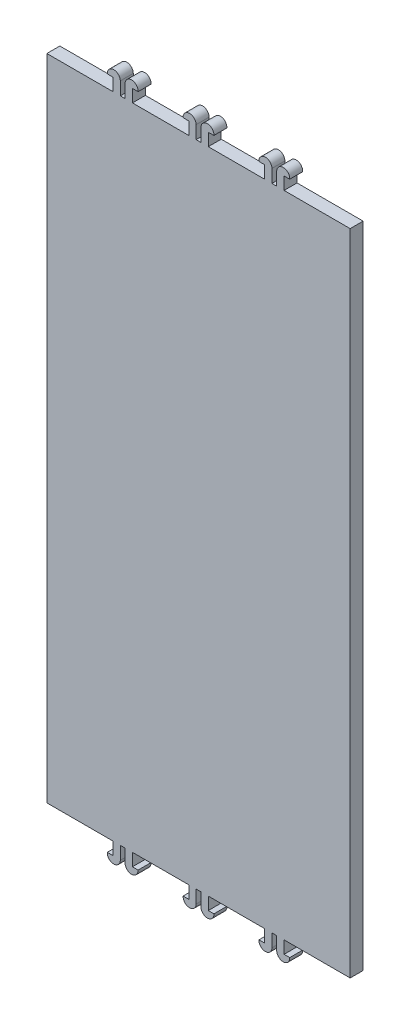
ISO-10303-21;
HEADER;
FILE_DESCRIPTION(('STEP AP214'),'2;1');
FILE_NAME('part.step','',(''),(''),'','','');
FILE_SCHEMA(('AUTOMOTIVE_DESIGN { 1 0 10303 214 1 1 1 1 }'));
ENDSEC;
DATA;
#1=APPLICATION_CONTEXT('core data for automotive mechanical design processes');
#2=APPLICATION_PROTOCOL_DEFINITION('international standard','automotive_design',2000,#1);
#3=PRODUCT_CONTEXT('',#1,'mechanical');
#4=PRODUCT('Part','Part','',(#3));
#5=PRODUCT_RELATED_PRODUCT_CATEGORY('part','',(#4));
#6=PRODUCT_DEFINITION_FORMATION('','',#4);
#7=PRODUCT_DEFINITION_CONTEXT('part definition',#1,'design');
#8=PRODUCT_DEFINITION('design','',#6,#7);
#9=PRODUCT_DEFINITION_SHAPE('','',#8);
#10=(LENGTH_UNIT() NAMED_UNIT(*) SI_UNIT(.MILLI.,.METRE.));
#11=(NAMED_UNIT(*) PLANE_ANGLE_UNIT() SI_UNIT($,.RADIAN.));
#12=(NAMED_UNIT(*) SI_UNIT($,.STERADIAN.) SOLID_ANGLE_UNIT());
#13=UNCERTAINTY_MEASURE_WITH_UNIT(LENGTH_MEASURE(1.E-05),#10,'distance_accuracy_value','');
#14=(GEOMETRIC_REPRESENTATION_CONTEXT(3) GLOBAL_UNCERTAINTY_ASSIGNED_CONTEXT((#13)) GLOBAL_UNIT_ASSIGNED_CONTEXT((#10,
#11,#12)) REPRESENTATION_CONTEXT('',''));
#15=CARTESIAN_POINT('',(0.,0.,0.));
#16=DIRECTION('',(0.,0.,1.));
#17=DIRECTION('',(1.,0.,0.));
#18=AXIS2_PLACEMENT_3D('',#15,#16,#17);
#19=CARTESIAN_POINT('',(0.553999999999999,0.,3.));
#20=DIRECTION('',(-1.,0.,0.));
#21=DIRECTION('',(0.,-1.,0.));
#22=AXIS2_PLACEMENT_3D('',#19,#20,#21);
#23=PLANE('',#22);
#24=DIRECTION('',(0.,1.,0.));
#25=VECTOR('',#24,1.);
#26=CARTESIAN_POINT('',(0.553999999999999,0.,0.));
#27=LINE('',#26,#25);
#28=CARTESIAN_POINT('',(0.553999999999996,37.5,0.));
#29=VERTEX_POINT('',#28);
#30=CARTESIAN_POINT('',(0.553999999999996,40.5,0.));
#31=VERTEX_POINT('',#30);
#32=EDGE_CURVE('E482',#29,#31,#27,.T.);
#33=ORIENTED_EDGE('',*,*,#32,.F.);
#34=DIRECTION('',(0.,0.,-1.));
#35=VECTOR('',#34,1.);
#36=CARTESIAN_POINT('',(0.553999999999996,37.5,3.));
#37=LINE('',#36,#35);
#38=CARTESIAN_POINT('',(0.553999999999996,37.5,3.));
#39=VERTEX_POINT('',#38);
#40=EDGE_CURVE('E11',#39,#29,#37,.T.);
#41=ORIENTED_EDGE('',*,*,#40,.F.);
#42=DIRECTION('',(0.,1.,0.));
#43=VECTOR('',#42,1.);
#44=CARTESIAN_POINT('',(0.553999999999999,0.,3.));
#45=LINE('',#44,#43);
#46=CARTESIAN_POINT('',(0.553999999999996,40.5,3.));
#47=VERTEX_POINT('',#46);
#48=EDGE_CURVE('E716',#39,#47,#45,.T.);
#49=ORIENTED_EDGE('',*,*,#48,.T.);
#50=DIRECTION('',(0.,0.,-1.));
#51=VECTOR('',#50,1.);
#52=CARTESIAN_POINT('',(0.553999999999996,40.5,3.));
#53=LINE('',#52,#51);
#54=EDGE_CURVE('E267',#47,#31,#53,.T.);
#55=ORIENTED_EDGE('',*,*,#54,.T.);
#56=EDGE_LOOP('',(#33,#41,#49,#55));
#57=FACE_BOUND('',#56,.T.);
#58=ADVANCED_FACE('F47',(#57),#23,.T.);
#59=CARTESIAN_POINT('',(-2.1540440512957E-13,37.5,3.));
#60=DIRECTION('',(0.,-1.,0.));
#61=DIRECTION('',(1.,0.,0.));
#62=AXIS2_PLACEMENT_3D('',#59,#60,#61);
#63=PLANE('',#62);
#64=DIRECTION('',(-1.,0.,0.));
#65=VECTOR('',#64,1.);
#66=CARTESIAN_POINT('',(-2.1540440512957E-13,37.5,0.));
#67=LINE('',#66,#65);
#68=CARTESIAN_POINT('',(-0.554000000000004,37.5,0.));
#69=VERTEX_POINT('',#68);
#70=EDGE_CURVE('E486',#29,#69,#67,.T.);
#71=ORIENTED_EDGE('',*,*,#70,.T.);
#72=DIRECTION('',(0.,0.,-1.));
#73=VECTOR('',#72,1.);
#74=CARTESIAN_POINT('',(-0.554000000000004,37.5,3.));
#75=LINE('',#74,#73);
#76=CARTESIAN_POINT('',(-0.554000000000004,37.5,3.));
#77=VERTEX_POINT('',#76);
#78=EDGE_CURVE('E56',#77,#69,#75,.T.);
#79=ORIENTED_EDGE('',*,*,#78,.F.);
#80=DIRECTION('',(-1.,0.,0.));
#81=VECTOR('',#80,1.);
#82=CARTESIAN_POINT('',(-2.1540440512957E-13,37.5,3.));
#83=LINE('',#82,#81);
#84=EDGE_CURVE('E940',#39,#77,#83,.T.);
#85=ORIENTED_EDGE('',*,*,#84,.F.);
#86=ORIENTED_EDGE('',*,*,#40,.T.);
#87=EDGE_LOOP('',(#71,#79,#85,#86));
#88=FACE_BOUND('',#87,.T.);
#89=ADVANCED_FACE('F1158',(#88),#63,.F.);
#90=CARTESIAN_POINT('',(-0.554000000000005,0.,3.));
#91=DIRECTION('',(-1.,0.,0.));
#92=DIRECTION('',(0.,-1.,0.));
#93=AXIS2_PLACEMENT_3D('',#90,#91,#92);
#94=PLANE('',#93);
#95=DIRECTION('',(0.,1.,0.));
#96=VECTOR('',#95,1.);
#97=CARTESIAN_POINT('',(-0.554000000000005,0.,0.));
#98=LINE('',#97,#96);
#99=CARTESIAN_POINT('',(-0.554000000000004,40.5,0.));
#100=VERTEX_POINT('',#99);
#101=EDGE_CURVE('E489',#69,#100,#98,.T.);
#102=ORIENTED_EDGE('',*,*,#101,.T.);
#103=DIRECTION('',(0.,0.,-1.));
#104=VECTOR('',#103,1.);
#105=CARTESIAN_POINT('',(-0.554000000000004,40.5,3.));
#106=LINE('',#105,#104);
#107=CARTESIAN_POINT('',(-0.554000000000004,40.5,3.));
#108=VERTEX_POINT('',#107);
#109=EDGE_CURVE('E909',#108,#100,#106,.T.);
#110=ORIENTED_EDGE('',*,*,#109,.F.);
#111=DIRECTION('',(0.,1.,0.));
#112=VECTOR('',#111,1.);
#113=CARTESIAN_POINT('',(-0.554000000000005,0.,3.));
#114=LINE('',#113,#112);
#115=EDGE_CURVE('E919',#77,#108,#114,.T.);
#116=ORIENTED_EDGE('',*,*,#115,.F.);
#117=ORIENTED_EDGE('',*,*,#78,.T.);
#118=EDGE_LOOP('',(#102,#110,#116,#117));
#119=FACE_BOUND('',#118,.T.);
#120=ADVANCED_FACE('F917',(#119),#94,.F.);
#121=CARTESIAN_POINT('',(-2.058,40.5,3.));
#122=DIRECTION('',(0.,0.,-1.));
#123=DIRECTION('',(-1.,0.,0.));
#124=AXIS2_PLACEMENT_3D('',#121,#122,#123);
#125=CYLINDRICAL_SURFACE('',#124,1.504);
#126=CARTESIAN_POINT('',(-2.058,40.5,0.));
#127=DIRECTION('',(0.,0.,1.));
#128=DIRECTION('',(1.,0.,0.));
#129=AXIS2_PLACEMENT_3D('',#126,#127,#128);
#130=CIRCLE('',#129,1.504);
#131=CARTESIAN_POINT('',(-3.5586718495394,40.4,0.));
#132=VERTEX_POINT('',#131);
#133=EDGE_CURVE('E493',#132,#100,#130,.F.);
#134=ORIENTED_EDGE('',*,*,#133,.F.);
#135=DIRECTION('',(0.,0.,-1.));
#136=VECTOR('',#135,1.);
#137=CARTESIAN_POINT('',(-3.5586718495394,40.4,3.));
#138=LINE('',#137,#136);
#139=CARTESIAN_POINT('',(-3.5586718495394,40.4,3.));
#140=VERTEX_POINT('',#139);
#141=EDGE_CURVE('E906',#140,#132,#138,.T.);
#142=ORIENTED_EDGE('',*,*,#141,.F.);
#143=CARTESIAN_POINT('',(-2.058,40.5,3.));
#144=DIRECTION('',(0.,0.,1.));
#145=DIRECTION('',(1.,0.,0.));
#146=AXIS2_PLACEMENT_3D('',#143,#144,#145);
#147=CIRCLE('',#146,1.504);
#148=EDGE_CURVE('E930',#140,#108,#147,.F.);
#149=ORIENTED_EDGE('',*,*,#148,.T.);
#150=ORIENTED_EDGE('',*,*,#109,.T.);
#151=EDGE_LOOP('',(#134,#142,#149,#150));
#152=FACE_BOUND('',#151,.T.);
#153=ADVANCED_FACE('F927',(#152),#125,.T.);
#154=CARTESIAN_POINT('',(0.,40.4,3.));
#155=DIRECTION('',(0.,-1.,0.));
#156=DIRECTION('',(0.,0.,-1.));
#157=AXIS2_PLACEMENT_3D('',#154,#155,#156);
#158=PLANE('',#157);
#159=DIRECTION('',(-1.,0.,0.));
#160=VECTOR('',#159,1.);
#161=CARTESIAN_POINT('',(0.,40.4,0.));
#162=LINE('',#161,#160);
#163=CARTESIAN_POINT('',(-2.254,40.4,0.));
#164=VERTEX_POINT('',#163);
#165=EDGE_CURVE('E497',#164,#132,#162,.T.);
#166=ORIENTED_EDGE('',*,*,#165,.F.);
#167=DIRECTION('',(0.,0.,-1.));
#168=VECTOR('',#167,1.);
#169=CARTESIAN_POINT('',(-2.254,40.4,3.));
#170=LINE('',#169,#168);
#171=CARTESIAN_POINT('',(-2.254,40.4,3.));
#172=VERTEX_POINT('',#171);
#173=EDGE_CURVE('E903',#172,#164,#170,.T.);
#174=ORIENTED_EDGE('',*,*,#173,.F.);
#175=DIRECTION('',(-1.,0.,0.));
#176=VECTOR('',#175,1.);
#177=CARTESIAN_POINT('',(0.,40.4,3.));
#178=LINE('',#177,#176);
#179=EDGE_CURVE('E934',#172,#140,#178,.T.);
#180=ORIENTED_EDGE('',*,*,#179,.T.);
#181=ORIENTED_EDGE('',*,*,#141,.T.);
#182=EDGE_LOOP('',(#166,#174,#180,#181));
#183=FACE_BOUND('',#182,.T.);
#184=ADVANCED_FACE('F1701',(#183),#158,.T.);
#185=CARTESIAN_POINT('',(-2.254,0.,3.));
#186=DIRECTION('',(-1.,0.,0.));
#187=DIRECTION('',(0.,0.,1.));
#188=AXIS2_PLACEMENT_3D('',#185,#186,#187);
#189=PLANE('',#188);
#190=DIRECTION('',(0.,1.,0.));
#191=VECTOR('',#190,1.);
#192=CARTESIAN_POINT('',(-2.254,0.,0.));
#193=LINE('',#192,#191);
#194=CARTESIAN_POINT('',(-2.254,37.5,0.));
#195=VERTEX_POINT('',#194);
#196=EDGE_CURVE('E501',#195,#164,#193,.T.);
#197=ORIENTED_EDGE('',*,*,#196,.F.);
#198=DIRECTION('',(0.,0.,-1.));
#199=VECTOR('',#198,1.);
#200=CARTESIAN_POINT('',(-2.254,37.5,3.));
#201=LINE('',#200,#199);
#202=CARTESIAN_POINT('',(-2.254,37.5,3.));
#203=VERTEX_POINT('',#202);
#204=EDGE_CURVE('E900',#203,#195,#201,.T.);
#205=ORIENTED_EDGE('',*,*,#204,.F.);
#206=DIRECTION('',(0.,1.,0.));
#207=VECTOR('',#206,1.);
#208=CARTESIAN_POINT('',(-2.254,0.,3.));
#209=LINE('',#208,#207);
#210=EDGE_CURVE('E938',#203,#172,#209,.T.);
#211=ORIENTED_EDGE('',*,*,#210,.T.);
#212=ORIENTED_EDGE('',*,*,#173,.T.);
#213=EDGE_LOOP('',(#197,#205,#211,#212));
#214=FACE_BOUND('',#213,.T.);
#215=ADVANCED_FACE('F1692',(#214),#189,.T.);
#216=CARTESIAN_POINT('',(0.,37.5,3.));
#217=DIRECTION('',(0.,-1.,0.));
#218=DIRECTION('',(0.,0.,-1.));
#219=AXIS2_PLACEMENT_3D('',#216,#217,#218);
#220=PLANE('',#219);
#221=DIRECTION('',(-1.,0.,0.));
#222=VECTOR('',#221,1.);
#223=CARTESIAN_POINT('',(0.,37.5,0.));
#224=LINE('',#223,#222);
#225=CARTESIAN_POINT('',(-15.271,37.5,0.));
#226=VERTEX_POINT('',#225);
#227=EDGE_CURVE('E505',#195,#226,#224,.T.);
#228=ORIENTED_EDGE('',*,*,#227,.T.);
#229=DIRECTION('',(0.,0.,-1.));
#230=VECTOR('',#229,1.);
#231=CARTESIAN_POINT('',(-15.271,37.5,3.));
#232=LINE('',#231,#230);
#233=CARTESIAN_POINT('',(-15.271,37.5,3.));
#234=VERTEX_POINT('',#233);
#235=EDGE_CURVE('E896',#234,#226,#232,.T.);
#236=ORIENTED_EDGE('',*,*,#235,.F.);
#237=DIRECTION('',(-1.,0.,0.));
#238=VECTOR('',#237,1.);
#239=CARTESIAN_POINT('',(0.,37.5,3.));
#240=LINE('',#239,#238);
#241=EDGE_CURVE('E947',#203,#234,#240,.T.);
#242=ORIENTED_EDGE('',*,*,#241,.F.);
#243=ORIENTED_EDGE('',*,*,#204,.T.);
#244=EDGE_LOOP('',(#228,#236,#242,#243));
#245=FACE_BOUND('',#244,.T.);
#246=ADVANCED_FACE('F1683',(#245),#220,.F.);
#247=CARTESIAN_POINT('',(-15.271,0.,3.));
#248=DIRECTION('',(-1.,0.,0.));
#249=DIRECTION('',(0.,-1.,0.));
#250=AXIS2_PLACEMENT_3D('',#247,#248,#249);
#251=PLANE('',#250);
#252=DIRECTION('',(0.,1.,0.));
#253=VECTOR('',#252,1.);
#254=CARTESIAN_POINT('',(-15.271,0.,0.));
#255=LINE('',#254,#253);
#256=CARTESIAN_POINT('',(-15.271,40.4,0.));
#257=VERTEX_POINT('',#256);
#258=EDGE_CURVE('E508',#226,#257,#255,.T.);
#259=ORIENTED_EDGE('',*,*,#258,.T.);
#260=DIRECTION('',(0.,0.,-1.));
#261=VECTOR('',#260,1.);
#262=CARTESIAN_POINT('',(-15.271,40.4,3.));
#263=LINE('',#262,#261);
#264=CARTESIAN_POINT('',(-15.271,40.4,3.));
#265=VERTEX_POINT('',#264);
#266=EDGE_CURVE('E892',#265,#257,#263,.T.);
#267=ORIENTED_EDGE('',*,*,#266,.F.);
#268=DIRECTION('',(0.,1.,0.));
#269=VECTOR('',#268,1.);
#270=CARTESIAN_POINT('',(-15.271,0.,3.));
#271=LINE('',#270,#269);
#272=EDGE_CURVE('E950',#234,#265,#271,.T.);
#273=ORIENTED_EDGE('',*,*,#272,.F.);
#274=ORIENTED_EDGE('',*,*,#235,.T.);
#275=EDGE_LOOP('',(#259,#267,#273,#274));
#276=FACE_BOUND('',#275,.T.);
#277=ADVANCED_FACE('F1674',(#276),#251,.F.);
#278=CARTESIAN_POINT('',(0.,40.4,3.));
#279=DIRECTION('',(0.,1.,0.));
#280=DIRECTION('',(0.,0.,1.));
#281=AXIS2_PLACEMENT_3D('',#278,#279,#280);
#282=PLANE('',#281);
#283=DIRECTION('',(1.,0.,0.));
#284=VECTOR('',#283,1.);
#285=CARTESIAN_POINT('',(0.,40.4,0.));
#286=LINE('',#285,#284);
#287=CARTESIAN_POINT('',(-13.9663281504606,40.4,0.));
#288=VERTEX_POINT('',#287);
#289=EDGE_CURVE('E511',#257,#288,#286,.T.);
#290=ORIENTED_EDGE('',*,*,#289,.T.);
#291=DIRECTION('',(0.,0.,-1.));
#292=VECTOR('',#291,1.);
#293=CARTESIAN_POINT('',(-13.9663281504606,40.4,3.));
#294=LINE('',#293,#292);
#295=CARTESIAN_POINT('',(-13.9663281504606,40.4,3.));
#296=VERTEX_POINT('',#295);
#297=EDGE_CURVE('E888',#296,#288,#294,.T.);
#298=ORIENTED_EDGE('',*,*,#297,.F.);
#299=DIRECTION('',(1.,0.,0.));
#300=VECTOR('',#299,1.);
#301=CARTESIAN_POINT('',(0.,40.4,3.));
#302=LINE('',#301,#300);
#303=EDGE_CURVE('E953',#265,#296,#302,.T.);
#304=ORIENTED_EDGE('',*,*,#303,.F.);
#305=ORIENTED_EDGE('',*,*,#266,.T.);
#306=EDGE_LOOP('',(#290,#298,#304,#305));
#307=FACE_BOUND('',#306,.T.);
#308=ADVANCED_FACE('F1665',(#307),#282,.F.);
#309=CARTESIAN_POINT('',(-15.467,40.5,3.));
#310=DIRECTION('',(0.,0.,-1.));
#311=DIRECTION('',(-1.,0.,0.));
#312=AXIS2_PLACEMENT_3D('',#309,#310,#311);
#313=CYLINDRICAL_SURFACE('',#312,1.504);
#314=CARTESIAN_POINT('',(-15.467,40.5,0.));
#315=DIRECTION('',(0.,0.,1.));
#316=DIRECTION('',(1.,0.,0.));
#317=AXIS2_PLACEMENT_3D('',#314,#315,#316);
#318=CIRCLE('',#317,1.504);
#319=CARTESIAN_POINT('',(-16.971,40.5,0.));
#320=VERTEX_POINT('',#319);
#321=EDGE_CURVE('E514',#288,#320,#318,.T.);
#322=ORIENTED_EDGE('',*,*,#321,.T.);
#323=DIRECTION('',(0.,0.,-1.));
#324=VECTOR('',#323,1.);
#325=CARTESIAN_POINT('',(-16.971,40.5,3.));
#326=LINE('',#325,#324);
#327=CARTESIAN_POINT('',(-16.971,40.5,3.));
#328=VERTEX_POINT('',#327);
#329=EDGE_CURVE('E885',#328,#320,#326,.T.);
#330=ORIENTED_EDGE('',*,*,#329,.F.);
#331=CARTESIAN_POINT('',(-15.467,40.5,3.));
#332=DIRECTION('',(0.,0.,1.));
#333=DIRECTION('',(1.,0.,0.));
#334=AXIS2_PLACEMENT_3D('',#331,#332,#333);
#335=CIRCLE('',#334,1.504);
#336=EDGE_CURVE('E956',#296,#328,#335,.T.);
#337=ORIENTED_EDGE('',*,*,#336,.F.);
#338=ORIENTED_EDGE('',*,*,#297,.T.);
#339=EDGE_LOOP('',(#322,#330,#337,#338));
#340=FACE_BOUND('',#339,.T.);
#341=ADVANCED_FACE('F1656',(#340),#313,.T.);
#342=CARTESIAN_POINT('',(-16.971,0.,3.));
#343=DIRECTION('',(-1.,0.,0.));
#344=DIRECTION('',(0.,0.,1.));
#345=AXIS2_PLACEMENT_3D('',#342,#343,#344);
#346=PLANE('',#345);
#347=DIRECTION('',(0.,1.,0.));
#348=VECTOR('',#347,1.);
#349=CARTESIAN_POINT('',(-16.971,0.,0.));
#350=LINE('',#349,#348);
#351=CARTESIAN_POINT('',(-16.971,37.5,0.));
#352=VERTEX_POINT('',#351);
#353=EDGE_CURVE('E518',#352,#320,#350,.T.);
#354=ORIENTED_EDGE('',*,*,#353,.F.);
#355=DIRECTION('',(0.,0.,-1.));
#356=VECTOR('',#355,1.);
#357=CARTESIAN_POINT('',(-16.971,37.5,3.));
#358=LINE('',#357,#356);
#359=CARTESIAN_POINT('',(-16.971,37.5,3.));
#360=VERTEX_POINT('',#359);
#361=EDGE_CURVE('E882',#360,#352,#358,.T.);
#362=ORIENTED_EDGE('',*,*,#361,.F.);
#363=DIRECTION('',(0.,1.,0.));
#364=VECTOR('',#363,1.);
#365=CARTESIAN_POINT('',(-16.971,0.,3.));
#366=LINE('',#365,#364);
#367=EDGE_CURVE('E959',#360,#328,#366,.T.);
#368=ORIENTED_EDGE('',*,*,#367,.T.);
#369=ORIENTED_EDGE('',*,*,#329,.T.);
#370=EDGE_LOOP('',(#354,#362,#368,#369));
#371=FACE_BOUND('',#370,.T.);
#372=ADVANCED_FACE('F1647',(#371),#346,.T.);
#373=CARTESIAN_POINT('',(0.,37.5,3.));
#374=DIRECTION('',(0.,1.,0.));
#375=DIRECTION('',(0.,0.,1.));
#376=AXIS2_PLACEMENT_3D('',#373,#374,#375);
#377=PLANE('',#376);
#378=DIRECTION('',(1.,0.,0.));
#379=VECTOR('',#378,1.);
#380=CARTESIAN_POINT('',(0.,37.5,0.));
#381=LINE('',#380,#379);
#382=CARTESIAN_POINT('',(-18.079,37.5,0.));
#383=VERTEX_POINT('',#382);
#384=EDGE_CURVE('E522',#383,#352,#381,.T.);
#385=ORIENTED_EDGE('',*,*,#384,.F.);
#386=DIRECTION('',(0.,0.,-1.));
#387=VECTOR('',#386,1.);
#388=CARTESIAN_POINT('',(-18.079,37.5,3.));
#389=LINE('',#388,#387);
#390=CARTESIAN_POINT('',(-18.079,37.5,3.));
#391=VERTEX_POINT('',#390);
#392=EDGE_CURVE('E879',#391,#383,#389,.T.);
#393=ORIENTED_EDGE('',*,*,#392,.F.);
#394=DIRECTION('',(1.,0.,0.));
#395=VECTOR('',#394,1.);
#396=CARTESIAN_POINT('',(0.,37.5,3.));
#397=LINE('',#396,#395);
#398=EDGE_CURVE('E963',#391,#360,#397,.T.);
#399=ORIENTED_EDGE('',*,*,#398,.T.);
#400=ORIENTED_EDGE('',*,*,#361,.T.);
#401=EDGE_LOOP('',(#385,#393,#399,#400));
#402=FACE_BOUND('',#401,.T.);
#403=ADVANCED_FACE('F1638',(#402),#377,.T.);
#404=CARTESIAN_POINT('',(-18.079,0.,3.));
#405=DIRECTION('',(-1.,0.,0.));
#406=DIRECTION('',(0.,0.,1.));
#407=AXIS2_PLACEMENT_3D('',#404,#405,#406);
#408=PLANE('',#407);
#409=DIRECTION('',(0.,1.,0.));
#410=VECTOR('',#409,1.);
#411=CARTESIAN_POINT('',(-18.079,0.,0.));
#412=LINE('',#411,#410);
#413=CARTESIAN_POINT('',(-18.079,40.5,0.));
#414=VERTEX_POINT('',#413);
#415=EDGE_CURVE('E526',#383,#414,#412,.T.);
#416=ORIENTED_EDGE('',*,*,#415,.T.);
#417=DIRECTION('',(0.,0.,-1.));
#418=VECTOR('',#417,1.);
#419=CARTESIAN_POINT('',(-18.079,40.5,3.));
#420=LINE('',#419,#418);
#421=CARTESIAN_POINT('',(-18.079,40.5,3.));
#422=VERTEX_POINT('',#421);
#423=EDGE_CURVE('E876',#422,#414,#420,.T.);
#424=ORIENTED_EDGE('',*,*,#423,.F.);
#425=DIRECTION('',(0.,1.,0.));
#426=VECTOR('',#425,1.);
#427=CARTESIAN_POINT('',(-18.079,0.,3.));
#428=LINE('',#427,#426);
#429=EDGE_CURVE('E967',#391,#422,#428,.T.);
#430=ORIENTED_EDGE('',*,*,#429,.F.);
#431=ORIENTED_EDGE('',*,*,#392,.T.);
#432=EDGE_LOOP('',(#416,#424,#430,#431));
#433=FACE_BOUND('',#432,.T.);
#434=ADVANCED_FACE('F1629',(#433),#408,.F.);
#435=CARTESIAN_POINT('',(-19.583,40.5,3.));
#436=DIRECTION('',(0.,0.,-1.));
#437=DIRECTION('',(-1.,0.,0.));
#438=AXIS2_PLACEMENT_3D('',#435,#436,#437);
#439=CYLINDRICAL_SURFACE('',#438,1.504);
#440=CARTESIAN_POINT('',(-19.583,40.5,0.));
#441=DIRECTION('',(0.,0.,1.));
#442=DIRECTION('',(1.,0.,0.));
#443=AXIS2_PLACEMENT_3D('',#440,#441,#442);
#444=CIRCLE('',#443,1.504);
#445=CARTESIAN_POINT('',(-21.0836718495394,40.4,0.));
#446=VERTEX_POINT('',#445);
#447=EDGE_CURVE('E530',#446,#414,#444,.F.);
#448=ORIENTED_EDGE('',*,*,#447,.F.);
#449=DIRECTION('',(0.,0.,-1.));
#450=VECTOR('',#449,1.);
#451=CARTESIAN_POINT('',(-21.0836718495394,40.4,3.));
#452=LINE('',#451,#450);
#453=CARTESIAN_POINT('',(-21.0836718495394,40.4,3.));
#454=VERTEX_POINT('',#453);
#455=EDGE_CURVE('E873',#454,#446,#452,.T.);
#456=ORIENTED_EDGE('',*,*,#455,.F.);
#457=CARTESIAN_POINT('',(-19.583,40.5,3.));
#458=DIRECTION('',(0.,0.,1.));
#459=DIRECTION('',(1.,0.,0.));
#460=AXIS2_PLACEMENT_3D('',#457,#458,#459);
#461=CIRCLE('',#460,1.504);
#462=EDGE_CURVE('E970',#454,#422,#461,.F.);
#463=ORIENTED_EDGE('',*,*,#462,.T.);
#464=ORIENTED_EDGE('',*,*,#423,.T.);
#465=EDGE_LOOP('',(#448,#456,#463,#464));
#466=FACE_BOUND('',#465,.T.);
#467=ADVANCED_FACE('F1620',(#466),#439,.T.);
#468=CARTESIAN_POINT('',(0.,40.4,3.));
#469=DIRECTION('',(0.,-1.,0.));
#470=DIRECTION('',(0.,0.,-1.));
#471=AXIS2_PLACEMENT_3D('',#468,#469,#470);
#472=PLANE('',#471);
#473=DIRECTION('',(-1.,0.,0.));
#474=VECTOR('',#473,1.);
#475=CARTESIAN_POINT('',(0.,40.4,0.));
#476=LINE('',#475,#474);
#477=CARTESIAN_POINT('',(-19.779,40.4,0.));
#478=VERTEX_POINT('',#477);
#479=EDGE_CURVE('E534',#478,#446,#476,.T.);
#480=ORIENTED_EDGE('',*,*,#479,.F.);
#481=DIRECTION('',(0.,0.,-1.));
#482=VECTOR('',#481,1.);
#483=CARTESIAN_POINT('',(-19.779,40.4,3.));
#484=LINE('',#483,#482);
#485=CARTESIAN_POINT('',(-19.779,40.4,3.));
#486=VERTEX_POINT('',#485);
#487=EDGE_CURVE('E870',#486,#478,#484,.T.);
#488=ORIENTED_EDGE('',*,*,#487,.F.);
#489=DIRECTION('',(-1.,0.,0.));
#490=VECTOR('',#489,1.);
#491=CARTESIAN_POINT('',(0.,40.4,3.));
#492=LINE('',#491,#490);
#493=EDGE_CURVE('E974',#486,#454,#492,.T.);
#494=ORIENTED_EDGE('',*,*,#493,.T.);
#495=ORIENTED_EDGE('',*,*,#455,.T.);
#496=EDGE_LOOP('',(#480,#488,#494,#495));
#497=FACE_BOUND('',#496,.T.);
#498=ADVANCED_FACE('F1611',(#497),#472,.T.);
#499=CARTESIAN_POINT('',(-19.779,0.,3.));
#500=DIRECTION('',(-1.,0.,0.));
#501=DIRECTION('',(0.,0.,1.));
#502=AXIS2_PLACEMENT_3D('',#499,#500,#501);
#503=PLANE('',#502);
#504=DIRECTION('',(0.,1.,0.));
#505=VECTOR('',#504,1.);
#506=CARTESIAN_POINT('',(-19.779,0.,0.));
#507=LINE('',#506,#505);
#508=CARTESIAN_POINT('',(-19.779,37.5,0.));
#509=VERTEX_POINT('',#508);
#510=EDGE_CURVE('E538',#509,#478,#507,.T.);
#511=ORIENTED_EDGE('',*,*,#510,.F.);
#512=DIRECTION('',(0.,0.,-1.));
#513=VECTOR('',#512,1.);
#514=CARTESIAN_POINT('',(-19.779,37.5,3.));
#515=LINE('',#514,#513);
#516=CARTESIAN_POINT('',(-19.779,37.5,3.));
#517=VERTEX_POINT('',#516);
#518=EDGE_CURVE('E867',#517,#509,#515,.T.);
#519=ORIENTED_EDGE('',*,*,#518,.F.);
#520=DIRECTION('',(0.,1.,0.));
#521=VECTOR('',#520,1.);
#522=CARTESIAN_POINT('',(-19.779,0.,3.));
#523=LINE('',#522,#521);
#524=EDGE_CURVE('E978',#517,#486,#523,.T.);
#525=ORIENTED_EDGE('',*,*,#524,.T.);
#526=ORIENTED_EDGE('',*,*,#487,.T.);
#527=EDGE_LOOP('',(#511,#519,#525,#526));
#528=FACE_BOUND('',#527,.T.);
#529=ADVANCED_FACE('F1602',(#528),#503,.T.);
#530=CARTESIAN_POINT('',(0.,37.5,3.));
#531=DIRECTION('',(0.,-1.,0.));
#532=DIRECTION('',(1.,0.,0.));
#533=AXIS2_PLACEMENT_3D('',#530,#531,#532);
#534=PLANE('',#533);
#535=DIRECTION('',(-1.,0.,0.));
#536=VECTOR('',#535,1.);
#537=CARTESIAN_POINT('',(0.,37.5,0.));
#538=LINE('',#537,#536);
#539=CARTESIAN_POINT('',(-35.05,37.5,0.));
#540=VERTEX_POINT('',#539);
#541=EDGE_CURVE('E542',#509,#540,#538,.T.);
#542=ORIENTED_EDGE('',*,*,#541,.T.);
#543=DIRECTION('',(0.,0.,-1.));
#544=VECTOR('',#543,1.);
#545=CARTESIAN_POINT('',(-35.05,37.5,3.));
#546=LINE('',#545,#544);
#547=CARTESIAN_POINT('',(-35.05,37.5,3.));
#548=VERTEX_POINT('',#547);
#549=EDGE_CURVE('E864',#548,#540,#546,.T.);
#550=ORIENTED_EDGE('',*,*,#549,.F.);
#551=DIRECTION('',(-1.,0.,0.));
#552=VECTOR('',#551,1.);
#553=CARTESIAN_POINT('',(0.,37.5,3.));
#554=LINE('',#553,#552);
#555=EDGE_CURVE('E982',#517,#548,#554,.T.);
#556=ORIENTED_EDGE('',*,*,#555,.F.);
#557=ORIENTED_EDGE('',*,*,#518,.T.);
#558=EDGE_LOOP('',(#542,#550,#556,#557));
#559=FACE_BOUND('',#558,.T.);
#560=ADVANCED_FACE('F1593',(#559),#534,.F.);
#561=CARTESIAN_POINT('',(-35.05,0.,3.));
#562=DIRECTION('',(-1.,0.,0.));
#563=DIRECTION('',(0.,-1.,0.));
#564=AXIS2_PLACEMENT_3D('',#561,#562,#563);
#565=PLANE('',#564);
#566=DIRECTION('',(0.,1.,0.));
#567=VECTOR('',#566,1.);
#568=CARTESIAN_POINT('',(-35.05,0.,0.));
#569=LINE('',#568,#567);
#570=CARTESIAN_POINT('',(-35.05,-112.5,0.));
#571=VERTEX_POINT('',#570);
#572=EDGE_CURVE('E546',#571,#540,#569,.T.);
#573=ORIENTED_EDGE('',*,*,#572,.F.);
#574=DIRECTION('',(0.,0.,-1.));
#575=VECTOR('',#574,1.);
#576=CARTESIAN_POINT('',(-35.05,-112.5,3.));
#577=LINE('',#576,#575);
#578=CARTESIAN_POINT('',(-35.05,-112.5,3.));
#579=VERTEX_POINT('',#578);
#580=EDGE_CURVE('E861',#579,#571,#577,.T.);
#581=ORIENTED_EDGE('',*,*,#580,.F.);
#582=DIRECTION('',(0.,1.,0.));
#583=VECTOR('',#582,1.);
#584=CARTESIAN_POINT('',(-35.05,0.,3.));
#585=LINE('',#584,#583);
#586=EDGE_CURVE('E985',#579,#548,#585,.T.);
#587=ORIENTED_EDGE('',*,*,#586,.T.);
#588=ORIENTED_EDGE('',*,*,#549,.T.);
#589=EDGE_LOOP('',(#573,#581,#587,#588));
#590=FACE_BOUND('',#589,.T.);
#591=ADVANCED_FACE('F1584',(#590),#565,.T.);
#592=CARTESIAN_POINT('',(1.02236338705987E-13,-112.5,3.));
#593=DIRECTION('',(0.,-1.,0.));
#594=DIRECTION('',(1.,0.,0.));
#595=AXIS2_PLACEMENT_3D('',#592,#593,#594);
#596=PLANE('',#595);
#597=DIRECTION('',(-1.,0.,0.));
#598=VECTOR('',#597,1.);
#599=CARTESIAN_POINT('',(1.02236338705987E-13,-112.5,0.));
#600=LINE('',#599,#598);
#601=CARTESIAN_POINT('',(-19.779,-112.5,0.));
#602=VERTEX_POINT('',#601);
#603=EDGE_CURVE('E550',#602,#571,#600,.T.);
#604=ORIENTED_EDGE('',*,*,#603,.F.);
#605=DIRECTION('',(0.,0.,-1.));
#606=VECTOR('',#605,1.);
#607=CARTESIAN_POINT('',(-19.779,-112.5,3.));
#608=LINE('',#607,#606);
#609=CARTESIAN_POINT('',(-19.779,-112.5,3.));
#610=VERTEX_POINT('',#609);
#611=EDGE_CURVE('E858',#610,#602,#608,.T.);
#612=ORIENTED_EDGE('',*,*,#611,.F.);
#613=DIRECTION('',(-1.,0.,0.));
#614=VECTOR('',#613,1.);
#615=CARTESIAN_POINT('',(1.02236338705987E-13,-112.5,3.));
#616=LINE('',#615,#614);
#617=EDGE_CURVE('E989',#610,#579,#616,.T.);
#618=ORIENTED_EDGE('',*,*,#617,.T.);
#619=ORIENTED_EDGE('',*,*,#580,.T.);
#620=EDGE_LOOP('',(#604,#612,#618,#619));
#621=FACE_BOUND('',#620,.T.);
#622=ADVANCED_FACE('F1575',(#621),#596,.T.);
#623=CARTESIAN_POINT('',(-19.779,0.,3.));
#624=DIRECTION('',(1.,0.,0.));
#625=DIRECTION('',(0.,0.,-1.));
#626=AXIS2_PLACEMENT_3D('',#623,#624,#625);
#627=PLANE('',#626);
#628=DIRECTION('',(0.,-1.,0.));
#629=VECTOR('',#628,1.);
#630=CARTESIAN_POINT('',(-19.779,0.,0.));
#631=LINE('',#630,#629);
#632=CARTESIAN_POINT('',(-19.779,-115.4,0.));
#633=VERTEX_POINT('',#632);
#634=EDGE_CURVE('E554',#602,#633,#631,.T.);
#635=ORIENTED_EDGE('',*,*,#634,.T.);
#636=DIRECTION('',(0.,0.,-1.));
#637=VECTOR('',#636,1.);
#638=CARTESIAN_POINT('',(-19.779,-115.4,3.));
#639=LINE('',#638,#637);
#640=CARTESIAN_POINT('',(-19.779,-115.4,3.));
#641=VERTEX_POINT('',#640);
#642=EDGE_CURVE('E854',#641,#633,#639,.T.);
#643=ORIENTED_EDGE('',*,*,#642,.F.);
#644=DIRECTION('',(0.,-1.,0.));
#645=VECTOR('',#644,1.);
#646=CARTESIAN_POINT('',(-19.779,0.,3.));
#647=LINE('',#646,#645);
#648=EDGE_CURVE('E993',#610,#641,#647,.T.);
#649=ORIENTED_EDGE('',*,*,#648,.F.);
#650=ORIENTED_EDGE('',*,*,#611,.T.);
#651=EDGE_LOOP('',(#635,#643,#649,#650));
#652=FACE_BOUND('',#651,.T.);
#653=ADVANCED_FACE('F1566',(#652),#627,.F.);
#654=CARTESIAN_POINT('',(0.,-115.4,3.));
#655=DIRECTION('',(0.,-1.,0.));
#656=DIRECTION('',(0.,0.,-1.));
#657=AXIS2_PLACEMENT_3D('',#654,#655,#656);
#658=PLANE('',#657);
#659=DIRECTION('',(-1.,0.,0.));
#660=VECTOR('',#659,1.);
#661=CARTESIAN_POINT('',(0.,-115.4,0.));
#662=LINE('',#661,#660);
#663=CARTESIAN_POINT('',(-21.0836718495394,-115.4,0.));
#664=VERTEX_POINT('',#663);
#665=EDGE_CURVE('E557',#633,#664,#662,.T.);
#666=ORIENTED_EDGE('',*,*,#665,.T.);
#667=DIRECTION('',(0.,0.,-1.));
#668=VECTOR('',#667,1.);
#669=CARTESIAN_POINT('',(-21.0836718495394,-115.4,3.));
#670=LINE('',#669,#668);
#671=CARTESIAN_POINT('',(-21.0836718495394,-115.4,3.));
#672=VERTEX_POINT('',#671);
#673=EDGE_CURVE('E850',#672,#664,#670,.T.);
#674=ORIENTED_EDGE('',*,*,#673,.F.);
#675=DIRECTION('',(-1.,0.,0.));
#676=VECTOR('',#675,1.);
#677=CARTESIAN_POINT('',(0.,-115.4,3.));
#678=LINE('',#677,#676);
#679=EDGE_CURVE('E996',#641,#672,#678,.T.);
#680=ORIENTED_EDGE('',*,*,#679,.F.);
#681=ORIENTED_EDGE('',*,*,#642,.T.);
#682=EDGE_LOOP('',(#666,#674,#680,#681));
#683=FACE_BOUND('',#682,.T.);
#684=ADVANCED_FACE('F1557',(#683),#658,.F.);
#685=CARTESIAN_POINT('',(-19.583,-115.5,3.));
#686=DIRECTION('',(0.,0.,-1.));
#687=DIRECTION('',(-1.,0.,0.));
#688=AXIS2_PLACEMENT_3D('',#685,#686,#687);
#689=CYLINDRICAL_SURFACE('',#688,1.504);
#690=CARTESIAN_POINT('',(-19.583,-115.5,0.));
#691=DIRECTION('',(0.,0.,1.));
#692=DIRECTION('',(1.,0.,0.));
#693=AXIS2_PLACEMENT_3D('',#690,#691,#692);
#694=CIRCLE('',#693,1.504);
#695=CARTESIAN_POINT('',(-18.079,-115.5,0.));
#696=VERTEX_POINT('',#695);
#697=EDGE_CURVE('E560',#664,#696,#694,.T.);
#698=ORIENTED_EDGE('',*,*,#697,.T.);
#699=DIRECTION('',(0.,0.,-1.));
#700=VECTOR('',#699,1.);
#701=CARTESIAN_POINT('',(-18.079,-115.5,3.));
#702=LINE('',#701,#700);
#703=CARTESIAN_POINT('',(-18.079,-115.5,3.));
#704=VERTEX_POINT('',#703);
#705=EDGE_CURVE('E847',#704,#696,#702,.T.);
#706=ORIENTED_EDGE('',*,*,#705,.F.);
#707=CARTESIAN_POINT('',(-19.583,-115.5,3.));
#708=DIRECTION('',(0.,0.,1.));
#709=DIRECTION('',(1.,0.,0.));
#710=AXIS2_PLACEMENT_3D('',#707,#708,#709);
#711=CIRCLE('',#710,1.504);
#712=EDGE_CURVE('E999',#672,#704,#711,.T.);
#713=ORIENTED_EDGE('',*,*,#712,.F.);
#714=ORIENTED_EDGE('',*,*,#673,.T.);
#715=EDGE_LOOP('',(#698,#706,#713,#714));
#716=FACE_BOUND('',#715,.T.);
#717=ADVANCED_FACE('F1548',(#716),#689,.T.);
#718=CARTESIAN_POINT('',(-18.079,0.,3.));
#719=DIRECTION('',(1.,0.,0.));
#720=DIRECTION('',(0.,0.,-1.));
#721=AXIS2_PLACEMENT_3D('',#718,#719,#720);
#722=PLANE('',#721);
#723=DIRECTION('',(0.,-1.,0.));
#724=VECTOR('',#723,1.);
#725=CARTESIAN_POINT('',(-18.079,0.,0.));
#726=LINE('',#725,#724);
#727=CARTESIAN_POINT('',(-18.079,-112.5,0.));
#728=VERTEX_POINT('',#727);
#729=EDGE_CURVE('E564',#728,#696,#726,.T.);
#730=ORIENTED_EDGE('',*,*,#729,.F.);
#731=DIRECTION('',(0.,0.,-1.));
#732=VECTOR('',#731,1.);
#733=CARTESIAN_POINT('',(-18.079,-112.5,3.));
#734=LINE('',#733,#732);
#735=CARTESIAN_POINT('',(-18.079,-112.5,3.));
#736=VERTEX_POINT('',#735);
#737=EDGE_CURVE('E844',#736,#728,#734,.T.);
#738=ORIENTED_EDGE('',*,*,#737,.F.);
#739=DIRECTION('',(0.,-1.,0.));
#740=VECTOR('',#739,1.);
#741=CARTESIAN_POINT('',(-18.079,0.,3.));
#742=LINE('',#741,#740);
#743=EDGE_CURVE('E1002',#736,#704,#742,.T.);
#744=ORIENTED_EDGE('',*,*,#743,.T.);
#745=ORIENTED_EDGE('',*,*,#705,.T.);
#746=EDGE_LOOP('',(#730,#738,#744,#745));
#747=FACE_BOUND('',#746,.T.);
#748=ADVANCED_FACE('F1539',(#747),#722,.T.);
#749=CARTESIAN_POINT('',(0.,-112.5,3.));
#750=DIRECTION('',(0.,1.,0.));
#751=DIRECTION('',(0.,0.,1.));
#752=AXIS2_PLACEMENT_3D('',#749,#750,#751);
#753=PLANE('',#752);
#754=DIRECTION('',(1.,0.,0.));
#755=VECTOR('',#754,1.);
#756=CARTESIAN_POINT('',(0.,-112.5,0.));
#757=LINE('',#756,#755);
#758=CARTESIAN_POINT('',(-16.971,-112.5,0.));
#759=VERTEX_POINT('',#758);
#760=EDGE_CURVE('E568',#728,#759,#757,.T.);
#761=ORIENTED_EDGE('',*,*,#760,.T.);
#762=DIRECTION('',(0.,0.,-1.));
#763=VECTOR('',#762,1.);
#764=CARTESIAN_POINT('',(-16.971,-112.5,3.));
#765=LINE('',#764,#763);
#766=CARTESIAN_POINT('',(-16.971,-112.5,3.));
#767=VERTEX_POINT('',#766);
#768=EDGE_CURVE('E840',#767,#759,#765,.T.);
#769=ORIENTED_EDGE('',*,*,#768,.F.);
#770=DIRECTION('',(1.,0.,0.));
#771=VECTOR('',#770,1.);
#772=CARTESIAN_POINT('',(0.,-112.5,3.));
#773=LINE('',#772,#771);
#774=EDGE_CURVE('E1006',#736,#767,#773,.T.);
#775=ORIENTED_EDGE('',*,*,#774,.F.);
#776=ORIENTED_EDGE('',*,*,#737,.T.);
#777=EDGE_LOOP('',(#761,#769,#775,#776));
#778=FACE_BOUND('',#777,.T.);
#779=ADVANCED_FACE('F1530',(#778),#753,.F.);
#780=CARTESIAN_POINT('',(-16.971,0.,3.));
#781=DIRECTION('',(1.,0.,0.));
#782=DIRECTION('',(0.,0.,-1.));
#783=AXIS2_PLACEMENT_3D('',#780,#781,#782);
#784=PLANE('',#783);
#785=DIRECTION('',(0.,-1.,0.));
#786=VECTOR('',#785,1.);
#787=CARTESIAN_POINT('',(-16.971,0.,0.));
#788=LINE('',#787,#786);
#789=CARTESIAN_POINT('',(-16.971,-115.5,0.));
#790=VERTEX_POINT('',#789);
#791=EDGE_CURVE('E571',#759,#790,#788,.T.);
#792=ORIENTED_EDGE('',*,*,#791,.T.);
#793=DIRECTION('',(0.,0.,-1.));
#794=VECTOR('',#793,1.);
#795=CARTESIAN_POINT('',(-16.971,-115.5,3.));
#796=LINE('',#795,#794);
#797=CARTESIAN_POINT('',(-16.971,-115.5,3.));
#798=VERTEX_POINT('',#797);
#799=EDGE_CURVE('E837',#798,#790,#796,.T.);
#800=ORIENTED_EDGE('',*,*,#799,.F.);
#801=DIRECTION('',(0.,-1.,0.));
#802=VECTOR('',#801,1.);
#803=CARTESIAN_POINT('',(-16.971,0.,3.));
#804=LINE('',#803,#802);
#805=EDGE_CURVE('E1009',#767,#798,#804,.T.);
#806=ORIENTED_EDGE('',*,*,#805,.F.);
#807=ORIENTED_EDGE('',*,*,#768,.T.);
#808=EDGE_LOOP('',(#792,#800,#806,#807));
#809=FACE_BOUND('',#808,.T.);
#810=ADVANCED_FACE('F1521',(#809),#784,.F.);
#811=CARTESIAN_POINT('',(-15.467,-115.5,3.));
#812=DIRECTION('',(0.,0.,-1.));
#813=DIRECTION('',(-1.,0.,0.));
#814=AXIS2_PLACEMENT_3D('',#811,#812,#813);
#815=CYLINDRICAL_SURFACE('',#814,1.504);
#816=CARTESIAN_POINT('',(-15.467,-115.5,0.));
#817=DIRECTION('',(0.,0.,1.));
#818=DIRECTION('',(1.,0.,0.));
#819=AXIS2_PLACEMENT_3D('',#816,#817,#818);
#820=CIRCLE('',#819,1.504);
#821=CARTESIAN_POINT('',(-13.9663281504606,-115.4,0.));
#822=VERTEX_POINT('',#821);
#823=EDGE_CURVE('E575',#822,#790,#820,.F.);
#824=ORIENTED_EDGE('',*,*,#823,.F.);
#825=DIRECTION('',(0.,0.,-1.));
#826=VECTOR('',#825,1.);
#827=CARTESIAN_POINT('',(-13.9663281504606,-115.4,3.));
#828=LINE('',#827,#826);
#829=CARTESIAN_POINT('',(-13.9663281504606,-115.4,3.));
#830=VERTEX_POINT('',#829);
#831=EDGE_CURVE('E834',#830,#822,#828,.T.);
#832=ORIENTED_EDGE('',*,*,#831,.F.);
#833=CARTESIAN_POINT('',(-15.467,-115.5,3.));
#834=DIRECTION('',(0.,0.,1.));
#835=DIRECTION('',(1.,0.,0.));
#836=AXIS2_PLACEMENT_3D('',#833,#834,#835);
#837=CIRCLE('',#836,1.504);
#838=EDGE_CURVE('E1012',#830,#798,#837,.F.);
#839=ORIENTED_EDGE('',*,*,#838,.T.);
#840=ORIENTED_EDGE('',*,*,#799,.T.);
#841=EDGE_LOOP('',(#824,#832,#839,#840));
#842=FACE_BOUND('',#841,.T.);
#843=ADVANCED_FACE('F1512',(#842),#815,.T.);
#844=CARTESIAN_POINT('',(0.,-115.4,3.));
#845=DIRECTION('',(0.,1.,0.));
#846=DIRECTION('',(0.,0.,1.));
#847=AXIS2_PLACEMENT_3D('',#844,#845,#846);
#848=PLANE('',#847);
#849=DIRECTION('',(1.,0.,0.));
#850=VECTOR('',#849,1.);
#851=CARTESIAN_POINT('',(0.,-115.4,0.));
#852=LINE('',#851,#850);
#853=CARTESIAN_POINT('',(-15.271,-115.4,0.));
#854=VERTEX_POINT('',#853);
#855=EDGE_CURVE('E579',#854,#822,#852,.T.);
#856=ORIENTED_EDGE('',*,*,#855,.F.);
#857=DIRECTION('',(0.,0.,-1.));
#858=VECTOR('',#857,1.);
#859=CARTESIAN_POINT('',(-15.271,-115.4,3.));
#860=LINE('',#859,#858);
#861=CARTESIAN_POINT('',(-15.271,-115.4,3.));
#862=VERTEX_POINT('',#861);
#863=EDGE_CURVE('E831',#862,#854,#860,.T.);
#864=ORIENTED_EDGE('',*,*,#863,.F.);
#865=DIRECTION('',(1.,0.,0.));
#866=VECTOR('',#865,1.);
#867=CARTESIAN_POINT('',(0.,-115.4,3.));
#868=LINE('',#867,#866);
#869=EDGE_CURVE('E1016',#862,#830,#868,.T.);
#870=ORIENTED_EDGE('',*,*,#869,.T.);
#871=ORIENTED_EDGE('',*,*,#831,.T.);
#872=EDGE_LOOP('',(#856,#864,#870,#871));
#873=FACE_BOUND('',#872,.T.);
#874=ADVANCED_FACE('F1503',(#873),#848,.T.);
#875=CARTESIAN_POINT('',(-15.2709999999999,0.,3.));
#876=DIRECTION('',(1.,0.,0.));
#877=DIRECTION('',(0.,1.,0.));
#878=AXIS2_PLACEMENT_3D('',#875,#876,#877);
#879=PLANE('',#878);
#880=DIRECTION('',(0.,-1.,0.));
#881=VECTOR('',#880,1.);
#882=CARTESIAN_POINT('',(-15.2709999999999,0.,0.));
#883=LINE('',#882,#881);
#884=CARTESIAN_POINT('',(-15.271,-112.5,0.));
#885=VERTEX_POINT('',#884);
#886=EDGE_CURVE('E583',#885,#854,#883,.T.);
#887=ORIENTED_EDGE('',*,*,#886,.F.);
#888=DIRECTION('',(0.,0.,-1.));
#889=VECTOR('',#888,1.);
#890=CARTESIAN_POINT('',(-15.271,-112.5,3.));
#891=LINE('',#890,#889);
#892=CARTESIAN_POINT('',(-15.271,-112.5,3.));
#893=VERTEX_POINT('',#892);
#894=EDGE_CURVE('E828',#893,#885,#891,.T.);
#895=ORIENTED_EDGE('',*,*,#894,.F.);
#896=DIRECTION('',(0.,-1.,0.));
#897=VECTOR('',#896,1.);
#898=CARTESIAN_POINT('',(-15.2709999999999,0.,3.));
#899=LINE('',#898,#897);
#900=EDGE_CURVE('E1020',#893,#862,#899,.T.);
#901=ORIENTED_EDGE('',*,*,#900,.T.);
#902=ORIENTED_EDGE('',*,*,#863,.T.);
#903=EDGE_LOOP('',(#887,#895,#901,#902));
#904=FACE_BOUND('',#903,.T.);
#905=ADVANCED_FACE('F1494',(#904),#879,.T.);
#906=CARTESIAN_POINT('',(0.,-112.5,3.));
#907=DIRECTION('',(0.,-1.,0.));
#908=DIRECTION('',(0.,0.,-1.));
#909=AXIS2_PLACEMENT_3D('',#906,#907,#908);
#910=PLANE('',#909);
#911=DIRECTION('',(-1.,0.,0.));
#912=VECTOR('',#911,1.);
#913=CARTESIAN_POINT('',(0.,-112.5,0.));
#914=LINE('',#913,#912);
#915=CARTESIAN_POINT('',(-2.254,-112.5,0.));
#916=VERTEX_POINT('',#915);
#917=EDGE_CURVE('E587',#916,#885,#914,.T.);
#918=ORIENTED_EDGE('',*,*,#917,.F.);
#919=DIRECTION('',(0.,0.,-1.));
#920=VECTOR('',#919,1.);
#921=CARTESIAN_POINT('',(-2.254,-112.5,3.));
#922=LINE('',#921,#920);
#923=CARTESIAN_POINT('',(-2.254,-112.5,3.));
#924=VERTEX_POINT('',#923);
#925=EDGE_CURVE('E825',#924,#916,#922,.T.);
#926=ORIENTED_EDGE('',*,*,#925,.F.);
#927=DIRECTION('',(-1.,0.,0.));
#928=VECTOR('',#927,1.);
#929=CARTESIAN_POINT('',(0.,-112.5,3.));
#930=LINE('',#929,#928);
#931=EDGE_CURVE('E1024',#924,#893,#930,.T.);
#932=ORIENTED_EDGE('',*,*,#931,.T.);
#933=ORIENTED_EDGE('',*,*,#894,.T.);
#934=EDGE_LOOP('',(#918,#926,#932,#933));
#935=FACE_BOUND('',#934,.T.);
#936=ADVANCED_FACE('F1485',(#935),#910,.T.);
#937=CARTESIAN_POINT('',(-2.254,0.,3.));
#938=DIRECTION('',(1.,0.,0.));
#939=DIRECTION('',(0.,0.,-1.));
#940=AXIS2_PLACEMENT_3D('',#937,#938,#939);
#941=PLANE('',#940);
#942=DIRECTION('',(0.,-1.,0.));
#943=VECTOR('',#942,1.);
#944=CARTESIAN_POINT('',(-2.254,0.,0.));
#945=LINE('',#944,#943);
#946=CARTESIAN_POINT('',(-2.254,-115.4,0.));
#947=VERTEX_POINT('',#946);
#948=EDGE_CURVE('E591',#916,#947,#945,.T.);
#949=ORIENTED_EDGE('',*,*,#948,.T.);
#950=DIRECTION('',(0.,0.,-1.));
#951=VECTOR('',#950,1.);
#952=CARTESIAN_POINT('',(-2.254,-115.4,3.));
#953=LINE('',#952,#951);
#954=CARTESIAN_POINT('',(-2.254,-115.4,3.));
#955=VERTEX_POINT('',#954);
#956=EDGE_CURVE('E821',#955,#947,#953,.T.);
#957=ORIENTED_EDGE('',*,*,#956,.F.);
#958=DIRECTION('',(0.,-1.,0.));
#959=VECTOR('',#958,1.);
#960=CARTESIAN_POINT('',(-2.254,0.,3.));
#961=LINE('',#960,#959);
#962=EDGE_CURVE('E1028',#924,#955,#961,.T.);
#963=ORIENTED_EDGE('',*,*,#962,.F.);
#964=ORIENTED_EDGE('',*,*,#925,.T.);
#965=EDGE_LOOP('',(#949,#957,#963,#964));
#966=FACE_BOUND('',#965,.T.);
#967=ADVANCED_FACE('F1476',(#966),#941,.F.);
#968=CARTESIAN_POINT('',(0.,-115.4,3.));
#969=DIRECTION('',(0.,-1.,0.));
#970=DIRECTION('',(0.,0.,-1.));
#971=AXIS2_PLACEMENT_3D('',#968,#969,#970);
#972=PLANE('',#971);
#973=DIRECTION('',(-1.,0.,0.));
#974=VECTOR('',#973,1.);
#975=CARTESIAN_POINT('',(0.,-115.4,0.));
#976=LINE('',#975,#974);
#977=CARTESIAN_POINT('',(-3.5586718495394,-115.4,0.));
#978=VERTEX_POINT('',#977);
#979=EDGE_CURVE('E594',#947,#978,#976,.T.);
#980=ORIENTED_EDGE('',*,*,#979,.T.);
#981=DIRECTION('',(0.,0.,-1.));
#982=VECTOR('',#981,1.);
#983=CARTESIAN_POINT('',(-3.5586718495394,-115.4,3.));
#984=LINE('',#983,#982);
#985=CARTESIAN_POINT('',(-3.5586718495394,-115.4,3.));
#986=VERTEX_POINT('',#985);
#987=EDGE_CURVE('E817',#986,#978,#984,.T.);
#988=ORIENTED_EDGE('',*,*,#987,.F.);
#989=DIRECTION('',(-1.,0.,0.));
#990=VECTOR('',#989,1.);
#991=CARTESIAN_POINT('',(0.,-115.4,3.));
#992=LINE('',#991,#990);
#993=EDGE_CURVE('E1031',#955,#986,#992,.T.);
#994=ORIENTED_EDGE('',*,*,#993,.F.);
#995=ORIENTED_EDGE('',*,*,#956,.T.);
#996=EDGE_LOOP('',(#980,#988,#994,#995));
#997=FACE_BOUND('',#996,.T.);
#998=ADVANCED_FACE('F1467',(#997),#972,.F.);
#999=CARTESIAN_POINT('',(-2.058,-115.5,3.));
#1000=DIRECTION('',(0.,0.,-1.));
#1001=DIRECTION('',(-1.,0.,0.));
#1002=AXIS2_PLACEMENT_3D('',#999,#1000,#1001);
#1003=CYLINDRICAL_SURFACE('',#1002,1.504);
#1004=CARTESIAN_POINT('',(-2.058,-115.5,0.));
#1005=DIRECTION('',(0.,0.,1.));
#1006=DIRECTION('',(1.,0.,0.));
#1007=AXIS2_PLACEMENT_3D('',#1004,#1005,#1006);
#1008=CIRCLE('',#1007,1.504);
#1009=CARTESIAN_POINT('',(-0.554000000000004,-115.5,0.));
#1010=VERTEX_POINT('',#1009);
#1011=EDGE_CURVE('E597',#978,#1010,#1008,.T.);
#1012=ORIENTED_EDGE('',*,*,#1011,.T.);
#1013=DIRECTION('',(0.,0.,-1.));
#1014=VECTOR('',#1013,1.);
#1015=CARTESIAN_POINT('',(-0.554000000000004,-115.5,3.));
#1016=LINE('',#1015,#1014);
#1017=CARTESIAN_POINT('',(-0.554000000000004,-115.5,3.));
#1018=VERTEX_POINT('',#1017);
#1019=EDGE_CURVE('E814',#1018,#1010,#1016,.T.);
#1020=ORIENTED_EDGE('',*,*,#1019,.F.);
#1021=CARTESIAN_POINT('',(-2.058,-115.5,3.));
#1022=DIRECTION('',(0.,0.,1.));
#1023=DIRECTION('',(1.,0.,0.));
#1024=AXIS2_PLACEMENT_3D('',#1021,#1022,#1023);
#1025=CIRCLE('',#1024,1.504);
#1026=EDGE_CURVE('E1034',#986,#1018,#1025,.T.);
#1027=ORIENTED_EDGE('',*,*,#1026,.F.);
#1028=ORIENTED_EDGE('',*,*,#987,.T.);
#1029=EDGE_LOOP('',(#1012,#1020,#1027,#1028));
#1030=FACE_BOUND('',#1029,.T.);
#1031=ADVANCED_FACE('F1458',(#1030),#1003,.T.);
#1032=CARTESIAN_POINT('',(-0.554000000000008,0.,3.));
#1033=DIRECTION('',(1.,0.,0.));
#1034=DIRECTION('',(0.,1.,0.));
#1035=AXIS2_PLACEMENT_3D('',#1032,#1033,#1034);
#1036=PLANE('',#1035);
#1037=DIRECTION('',(0.,-1.,0.));
#1038=VECTOR('',#1037,1.);
#1039=CARTESIAN_POINT('',(-0.554000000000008,0.,0.));
#1040=LINE('',#1039,#1038);
#1041=CARTESIAN_POINT('',(-0.554000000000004,-112.5,0.));
#1042=VERTEX_POINT('',#1041);
#1043=EDGE_CURVE('E601',#1042,#1010,#1040,.T.);
#1044=ORIENTED_EDGE('',*,*,#1043,.F.);
#1045=DIRECTION('',(0.,0.,-1.));
#1046=VECTOR('',#1045,1.);
#1047=CARTESIAN_POINT('',(-0.554000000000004,-112.5,3.));
#1048=LINE('',#1047,#1046);
#1049=CARTESIAN_POINT('',(-0.554000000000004,-112.5,3.));
#1050=VERTEX_POINT('',#1049);
#1051=EDGE_CURVE('E811',#1050,#1042,#1048,.T.);
#1052=ORIENTED_EDGE('',*,*,#1051,.F.);
#1053=DIRECTION('',(0.,-1.,0.));
#1054=VECTOR('',#1053,1.);
#1055=CARTESIAN_POINT('',(-0.554000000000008,0.,3.));
#1056=LINE('',#1055,#1054);
#1057=EDGE_CURVE('E1037',#1050,#1018,#1056,.T.);
#1058=ORIENTED_EDGE('',*,*,#1057,.T.);
#1059=ORIENTED_EDGE('',*,*,#1019,.T.);
#1060=EDGE_LOOP('',(#1044,#1052,#1058,#1059));
#1061=FACE_BOUND('',#1060,.T.);
#1062=ADVANCED_FACE('F1449',(#1061),#1036,.T.);
#1063=CARTESIAN_POINT('',(0.,-112.5,3.));
#1064=DIRECTION('',(0.,-1.,0.));
#1065=DIRECTION('',(0.,0.,-1.));
#1066=AXIS2_PLACEMENT_3D('',#1063,#1064,#1065);
#1067=PLANE('',#1066);
#1068=DIRECTION('',(-1.,0.,0.));
#1069=VECTOR('',#1068,1.);
#1070=CARTESIAN_POINT('',(0.,-112.5,0.));
#1071=LINE('',#1070,#1069);
#1072=CARTESIAN_POINT('',(0.553999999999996,-112.5,0.));
#1073=VERTEX_POINT('',#1072);
#1074=EDGE_CURVE('E605',#1073,#1042,#1071,.T.);
#1075=ORIENTED_EDGE('',*,*,#1074,.F.);
#1076=DIRECTION('',(0.,0.,-1.));
#1077=VECTOR('',#1076,1.);
#1078=CARTESIAN_POINT('',(0.553999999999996,-112.5,3.));
#1079=LINE('',#1078,#1077);
#1080=CARTESIAN_POINT('',(0.553999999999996,-112.5,3.));
#1081=VERTEX_POINT('',#1080);
#1082=EDGE_CURVE('E808',#1081,#1073,#1079,.T.);
#1083=ORIENTED_EDGE('',*,*,#1082,.F.);
#1084=DIRECTION('',(-1.,0.,0.));
#1085=VECTOR('',#1084,1.);
#1086=CARTESIAN_POINT('',(0.,-112.5,3.));
#1087=LINE('',#1086,#1085);
#1088=EDGE_CURVE('E1041',#1081,#1050,#1087,.T.);
#1089=ORIENTED_EDGE('',*,*,#1088,.T.);
#1090=ORIENTED_EDGE('',*,*,#1051,.T.);
#1091=EDGE_LOOP('',(#1075,#1083,#1089,#1090));
#1092=FACE_BOUND('',#1091,.T.);
#1093=ADVANCED_FACE('F1440',(#1092),#1067,.T.);
#1094=CARTESIAN_POINT('',(0.554000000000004,0.,3.));
#1095=DIRECTION('',(1.,0.,0.));
#1096=DIRECTION('',(0.,1.,0.));
#1097=AXIS2_PLACEMENT_3D('',#1094,#1095,#1096);
#1098=PLANE('',#1097);
#1099=DIRECTION('',(0.,-1.,0.));
#1100=VECTOR('',#1099,1.);
#1101=CARTESIAN_POINT('',(0.554000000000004,0.,0.));
#1102=LINE('',#1101,#1100);
#1103=CARTESIAN_POINT('',(0.553999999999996,-115.5,0.));
#1104=VERTEX_POINT('',#1103);
#1105=EDGE_CURVE('E609',#1073,#1104,#1102,.T.);
#1106=ORIENTED_EDGE('',*,*,#1105,.T.);
#1107=DIRECTION('',(0.,0.,-1.));
#1108=VECTOR('',#1107,1.);
#1109=CARTESIAN_POINT('',(0.553999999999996,-115.5,3.));
#1110=LINE('',#1109,#1108);
#1111=CARTESIAN_POINT('',(0.553999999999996,-115.5,3.));
#1112=VERTEX_POINT('',#1111);
#1113=EDGE_CURVE('E805',#1112,#1104,#1110,.T.);
#1114=ORIENTED_EDGE('',*,*,#1113,.F.);
#1115=DIRECTION('',(0.,-1.,0.));
#1116=VECTOR('',#1115,1.);
#1117=CARTESIAN_POINT('',(0.554000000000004,0.,3.));
#1118=LINE('',#1117,#1116);
#1119=EDGE_CURVE('E1045',#1081,#1112,#1118,.T.);
#1120=ORIENTED_EDGE('',*,*,#1119,.F.);
#1121=ORIENTED_EDGE('',*,*,#1082,.T.);
#1122=EDGE_LOOP('',(#1106,#1114,#1120,#1121));
#1123=FACE_BOUND('',#1122,.T.);
#1124=ADVANCED_FACE('F1431',(#1123),#1098,.F.);
#1125=CARTESIAN_POINT('',(2.058,-115.5,3.));
#1126=DIRECTION('',(0.,0.,-1.));
#1127=DIRECTION('',(-1.,0.,0.));
#1128=AXIS2_PLACEMENT_3D('',#1125,#1126,#1127);
#1129=CYLINDRICAL_SURFACE('',#1128,1.504);
#1130=CARTESIAN_POINT('',(2.058,-115.5,0.));
#1131=DIRECTION('',(0.,0.,1.));
#1132=DIRECTION('',(1.,0.,0.));
#1133=AXIS2_PLACEMENT_3D('',#1130,#1131,#1132);
#1134=CIRCLE('',#1133,1.504);
#1135=CARTESIAN_POINT('',(3.5586718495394,-115.4,0.));
#1136=VERTEX_POINT('',#1135);
#1137=EDGE_CURVE('E613',#1136,#1104,#1134,.F.);
#1138=ORIENTED_EDGE('',*,*,#1137,.F.);
#1139=DIRECTION('',(0.,0.,-1.));
#1140=VECTOR('',#1139,1.);
#1141=CARTESIAN_POINT('',(3.5586718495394,-115.4,3.));
#1142=LINE('',#1141,#1140);
#1143=CARTESIAN_POINT('',(3.5586718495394,-115.4,3.));
#1144=VERTEX_POINT('',#1143);
#1145=EDGE_CURVE('E802',#1144,#1136,#1142,.T.);
#1146=ORIENTED_EDGE('',*,*,#1145,.F.);
#1147=CARTESIAN_POINT('',(2.058,-115.5,3.));
#1148=DIRECTION('',(0.,0.,1.));
#1149=DIRECTION('',(1.,0.,0.));
#1150=AXIS2_PLACEMENT_3D('',#1147,#1148,#1149);
#1151=CIRCLE('',#1150,1.504);
#1152=EDGE_CURVE('E1048',#1144,#1112,#1151,.F.);
#1153=ORIENTED_EDGE('',*,*,#1152,.T.);
#1154=ORIENTED_EDGE('',*,*,#1113,.T.);
#1155=EDGE_LOOP('',(#1138,#1146,#1153,#1154));
#1156=FACE_BOUND('',#1155,.T.);
#1157=ADVANCED_FACE('F1422',(#1156),#1129,.T.);
#1158=CARTESIAN_POINT('',(0.,-115.4,3.));
#1159=DIRECTION('',(0.,1.,0.));
#1160=DIRECTION('',(0.,0.,1.));
#1161=AXIS2_PLACEMENT_3D('',#1158,#1159,#1160);
#1162=PLANE('',#1161);
#1163=DIRECTION('',(1.,0.,0.));
#1164=VECTOR('',#1163,1.);
#1165=CARTESIAN_POINT('',(0.,-115.4,0.));
#1166=LINE('',#1165,#1164);
#1167=CARTESIAN_POINT('',(2.254,-115.4,0.));
#1168=VERTEX_POINT('',#1167);
#1169=EDGE_CURVE('E617',#1168,#1136,#1166,.T.);
#1170=ORIENTED_EDGE('',*,*,#1169,.F.);
#1171=DIRECTION('',(0.,0.,-1.));
#1172=VECTOR('',#1171,1.);
#1173=CARTESIAN_POINT('',(2.254,-115.4,3.));
#1174=LINE('',#1173,#1172);
#1175=CARTESIAN_POINT('',(2.254,-115.4,3.));
#1176=VERTEX_POINT('',#1175);
#1177=EDGE_CURVE('E799',#1176,#1168,#1174,.T.);
#1178=ORIENTED_EDGE('',*,*,#1177,.F.);
#1179=DIRECTION('',(1.,0.,0.));
#1180=VECTOR('',#1179,1.);
#1181=CARTESIAN_POINT('',(0.,-115.4,3.));
#1182=LINE('',#1181,#1180);
#1183=EDGE_CURVE('E1052',#1176,#1144,#1182,.T.);
#1184=ORIENTED_EDGE('',*,*,#1183,.T.);
#1185=ORIENTED_EDGE('',*,*,#1145,.T.);
#1186=EDGE_LOOP('',(#1170,#1178,#1184,#1185));
#1187=FACE_BOUND('',#1186,.T.);
#1188=ADVANCED_FACE('F1413',(#1187),#1162,.T.);
#1189=CARTESIAN_POINT('',(2.254,0.,3.));
#1190=DIRECTION('',(1.,0.,0.));
#1191=DIRECTION('',(0.,0.,-1.));
#1192=AXIS2_PLACEMENT_3D('',#1189,#1190,#1191);
#1193=PLANE('',#1192);
#1194=DIRECTION('',(0.,-1.,0.));
#1195=VECTOR('',#1194,1.);
#1196=CARTESIAN_POINT('',(2.254,0.,0.));
#1197=LINE('',#1196,#1195);
#1198=CARTESIAN_POINT('',(2.254,-112.5,0.));
#1199=VERTEX_POINT('',#1198);
#1200=EDGE_CURVE('E621',#1199,#1168,#1197,.T.);
#1201=ORIENTED_EDGE('',*,*,#1200,.F.);
#1202=DIRECTION('',(0.,0.,-1.));
#1203=VECTOR('',#1202,1.);
#1204=CARTESIAN_POINT('',(2.254,-112.5,3.));
#1205=LINE('',#1204,#1203);
#1206=CARTESIAN_POINT('',(2.254,-112.5,3.));
#1207=VERTEX_POINT('',#1206);
#1208=EDGE_CURVE('E796',#1207,#1199,#1205,.T.);
#1209=ORIENTED_EDGE('',*,*,#1208,.F.);
#1210=DIRECTION('',(0.,-1.,0.));
#1211=VECTOR('',#1210,1.);
#1212=CARTESIAN_POINT('',(2.254,0.,3.));
#1213=LINE('',#1212,#1211);
#1214=EDGE_CURVE('E1056',#1207,#1176,#1213,.T.);
#1215=ORIENTED_EDGE('',*,*,#1214,.T.);
#1216=ORIENTED_EDGE('',*,*,#1177,.T.);
#1217=EDGE_LOOP('',(#1201,#1209,#1215,#1216));
#1218=FACE_BOUND('',#1217,.T.);
#1219=ADVANCED_FACE('F1404',(#1218),#1193,.T.);
#1220=CARTESIAN_POINT('',(0.,-112.5,3.));
#1221=DIRECTION('',(0.,-1.,0.));
#1222=DIRECTION('',(0.,0.,-1.));
#1223=AXIS2_PLACEMENT_3D('',#1220,#1221,#1222);
#1224=PLANE('',#1223);
#1225=DIRECTION('',(-1.,0.,0.));
#1226=VECTOR('',#1225,1.);
#1227=CARTESIAN_POINT('',(0.,-112.5,0.));
#1228=LINE('',#1227,#1226);
#1229=CARTESIAN_POINT('',(15.266,-112.5,0.));
#1230=VERTEX_POINT('',#1229);
#1231=EDGE_CURVE('E625',#1230,#1199,#1228,.T.);
#1232=ORIENTED_EDGE('',*,*,#1231,.F.);
#1233=DIRECTION('',(0.,0.,-1.));
#1234=VECTOR('',#1233,1.);
#1235=CARTESIAN_POINT('',(15.266,-112.5,3.));
#1236=LINE('',#1235,#1234);
#1237=CARTESIAN_POINT('',(15.266,-112.5,3.));
#1238=VERTEX_POINT('',#1237);
#1239=EDGE_CURVE('E793',#1238,#1230,#1236,.T.);
#1240=ORIENTED_EDGE('',*,*,#1239,.F.);
#1241=DIRECTION('',(-1.,0.,0.));
#1242=VECTOR('',#1241,1.);
#1243=CARTESIAN_POINT('',(0.,-112.5,3.));
#1244=LINE('',#1243,#1242);
#1245=EDGE_CURVE('E1060',#1238,#1207,#1244,.T.);
#1246=ORIENTED_EDGE('',*,*,#1245,.T.);
#1247=ORIENTED_EDGE('',*,*,#1208,.T.);
#1248=EDGE_LOOP('',(#1232,#1240,#1246,#1247));
#1249=FACE_BOUND('',#1248,.T.);
#1250=ADVANCED_FACE('F1395',(#1249),#1224,.T.);
#1251=CARTESIAN_POINT('',(15.2660000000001,0.,3.));
#1252=DIRECTION('',(1.,0.,0.));
#1253=DIRECTION('',(0.,1.,0.));
#1254=AXIS2_PLACEMENT_3D('',#1251,#1252,#1253);
#1255=PLANE('',#1254);
#1256=DIRECTION('',(0.,-1.,0.));
#1257=VECTOR('',#1256,1.);
#1258=CARTESIAN_POINT('',(15.2660000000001,0.,0.));
#1259=LINE('',#1258,#1257);
#1260=CARTESIAN_POINT('',(15.266,-115.4,0.));
#1261=VERTEX_POINT('',#1260);
#1262=EDGE_CURVE('E629',#1230,#1261,#1259,.T.);
#1263=ORIENTED_EDGE('',*,*,#1262,.T.);
#1264=DIRECTION('',(0.,0.,-1.));
#1265=VECTOR('',#1264,1.);
#1266=CARTESIAN_POINT('',(15.266,-115.4,3.));
#1267=LINE('',#1266,#1265);
#1268=CARTESIAN_POINT('',(15.266,-115.4,3.));
#1269=VERTEX_POINT('',#1268);
#1270=EDGE_CURVE('E789',#1269,#1261,#1267,.T.);
#1271=ORIENTED_EDGE('',*,*,#1270,.F.);
#1272=DIRECTION('',(0.,-1.,0.));
#1273=VECTOR('',#1272,1.);
#1274=CARTESIAN_POINT('',(15.2660000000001,0.,3.));
#1275=LINE('',#1274,#1273);
#1276=EDGE_CURVE('E1064',#1238,#1269,#1275,.T.);
#1277=ORIENTED_EDGE('',*,*,#1276,.F.);
#1278=ORIENTED_EDGE('',*,*,#1239,.T.);
#1279=EDGE_LOOP('',(#1263,#1271,#1277,#1278));
#1280=FACE_BOUND('',#1279,.T.);
#1281=ADVANCED_FACE('F1386',(#1280),#1255,.F.);
#1282=CARTESIAN_POINT('',(0.,-115.4,3.));
#1283=DIRECTION('',(0.,-1.,0.));
#1284=DIRECTION('',(0.,0.,-1.));
#1285=AXIS2_PLACEMENT_3D('',#1282,#1283,#1284);
#1286=PLANE('',#1285);
#1287=DIRECTION('',(-1.,0.,0.));
#1288=VECTOR('',#1287,1.);
#1289=CARTESIAN_POINT('',(0.,-115.4,0.));
#1290=LINE('',#1289,#1288);
#1291=CARTESIAN_POINT('',(13.9613281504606,-115.4,0.));
#1292=VERTEX_POINT('',#1291);
#1293=EDGE_CURVE('E632',#1261,#1292,#1290,.T.);
#1294=ORIENTED_EDGE('',*,*,#1293,.T.);
#1295=DIRECTION('',(0.,0.,-1.));
#1296=VECTOR('',#1295,1.);
#1297=CARTESIAN_POINT('',(13.9613281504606,-115.4,3.));
#1298=LINE('',#1297,#1296);
#1299=CARTESIAN_POINT('',(13.9613281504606,-115.4,3.));
#1300=VERTEX_POINT('',#1299);
#1301=EDGE_CURVE('E785',#1300,#1292,#1298,.T.);
#1302=ORIENTED_EDGE('',*,*,#1301,.F.);
#1303=DIRECTION('',(-1.,0.,0.));
#1304=VECTOR('',#1303,1.);
#1305=CARTESIAN_POINT('',(0.,-115.4,3.));
#1306=LINE('',#1305,#1304);
#1307=EDGE_CURVE('E1067',#1269,#1300,#1306,.T.);
#1308=ORIENTED_EDGE('',*,*,#1307,.F.);
#1309=ORIENTED_EDGE('',*,*,#1270,.T.);
#1310=EDGE_LOOP('',(#1294,#1302,#1308,#1309));
#1311=FACE_BOUND('',#1310,.T.);
#1312=ADVANCED_FACE('F1377',(#1311),#1286,.F.);
#1313=CARTESIAN_POINT('',(15.462,-115.5,3.));
#1314=DIRECTION('',(0.,0.,-1.));
#1315=DIRECTION('',(-1.,0.,0.));
#1316=AXIS2_PLACEMENT_3D('',#1313,#1314,#1315);
#1317=CYLINDRICAL_SURFACE('',#1316,1.504);
#1318=CARTESIAN_POINT('',(15.462,-115.5,0.));
#1319=DIRECTION('',(0.,0.,1.));
#1320=DIRECTION('',(1.,0.,0.));
#1321=AXIS2_PLACEMENT_3D('',#1318,#1319,#1320);
#1322=CIRCLE('',#1321,1.504);
#1323=CARTESIAN_POINT('',(16.966,-115.5,0.));
#1324=VERTEX_POINT('',#1323);
#1325=EDGE_CURVE('E635',#1292,#1324,#1322,.T.);
#1326=ORIENTED_EDGE('',*,*,#1325,.T.);
#1327=DIRECTION('',(0.,0.,-1.));
#1328=VECTOR('',#1327,1.);
#1329=CARTESIAN_POINT('',(16.966,-115.5,3.));
#1330=LINE('',#1329,#1328);
#1331=CARTESIAN_POINT('',(16.966,-115.5,3.));
#1332=VERTEX_POINT('',#1331);
#1333=EDGE_CURVE('E782',#1332,#1324,#1330,.T.);
#1334=ORIENTED_EDGE('',*,*,#1333,.F.);
#1335=CARTESIAN_POINT('',(15.462,-115.5,3.));
#1336=DIRECTION('',(0.,0.,1.));
#1337=DIRECTION('',(1.,0.,0.));
#1338=AXIS2_PLACEMENT_3D('',#1335,#1336,#1337);
#1339=CIRCLE('',#1338,1.504);
#1340=EDGE_CURVE('E1070',#1300,#1332,#1339,.T.);
#1341=ORIENTED_EDGE('',*,*,#1340,.F.);
#1342=ORIENTED_EDGE('',*,*,#1301,.T.);
#1343=EDGE_LOOP('',(#1326,#1334,#1341,#1342));
#1344=FACE_BOUND('',#1343,.T.);
#1345=ADVANCED_FACE('F1368',(#1344),#1317,.T.);
#1346=CARTESIAN_POINT('',(16.966,0.,3.));
#1347=DIRECTION('',(1.,0.,0.));
#1348=DIRECTION('',(0.,0.,-1.));
#1349=AXIS2_PLACEMENT_3D('',#1346,#1347,#1348);
#1350=PLANE('',#1349);
#1351=DIRECTION('',(0.,-1.,0.));
#1352=VECTOR('',#1351,1.);
#1353=CARTESIAN_POINT('',(16.966,0.,0.));
#1354=LINE('',#1353,#1352);
#1355=CARTESIAN_POINT('',(16.966,-112.5,0.));
#1356=VERTEX_POINT('',#1355);
#1357=EDGE_CURVE('E639',#1356,#1324,#1354,.T.);
#1358=ORIENTED_EDGE('',*,*,#1357,.F.);
#1359=DIRECTION('',(0.,0.,-1.));
#1360=VECTOR('',#1359,1.);
#1361=CARTESIAN_POINT('',(16.966,-112.5,3.));
#1362=LINE('',#1361,#1360);
#1363=CARTESIAN_POINT('',(16.966,-112.5,3.));
#1364=VERTEX_POINT('',#1363);
#1365=EDGE_CURVE('E779',#1364,#1356,#1362,.T.);
#1366=ORIENTED_EDGE('',*,*,#1365,.F.);
#1367=DIRECTION('',(0.,-1.,0.));
#1368=VECTOR('',#1367,1.);
#1369=CARTESIAN_POINT('',(16.966,0.,3.));
#1370=LINE('',#1369,#1368);
#1371=EDGE_CURVE('E1073',#1364,#1332,#1370,.T.);
#1372=ORIENTED_EDGE('',*,*,#1371,.T.);
#1373=ORIENTED_EDGE('',*,*,#1333,.T.);
#1374=EDGE_LOOP('',(#1358,#1366,#1372,#1373));
#1375=FACE_BOUND('',#1374,.T.);
#1376=ADVANCED_FACE('F1359',(#1375),#1350,.T.);
#1377=CARTESIAN_POINT('',(0.,-112.5,3.));
#1378=DIRECTION('',(0.,1.,0.));
#1379=DIRECTION('',(0.,0.,1.));
#1380=AXIS2_PLACEMENT_3D('',#1377,#1378,#1379);
#1381=PLANE('',#1380);
#1382=DIRECTION('',(1.,0.,0.));
#1383=VECTOR('',#1382,1.);
#1384=CARTESIAN_POINT('',(0.,-112.5,0.));
#1385=LINE('',#1384,#1383);
#1386=CARTESIAN_POINT('',(18.074,-112.5,0.));
#1387=VERTEX_POINT('',#1386);
#1388=EDGE_CURVE('E643',#1356,#1387,#1385,.T.);
#1389=ORIENTED_EDGE('',*,*,#1388,.T.);
#1390=DIRECTION('',(0.,0.,-1.));
#1391=VECTOR('',#1390,1.);
#1392=CARTESIAN_POINT('',(18.074,-112.5,3.));
#1393=LINE('',#1392,#1391);
#1394=CARTESIAN_POINT('',(18.074,-112.5,3.));
#1395=VERTEX_POINT('',#1394);
#1396=EDGE_CURVE('E775',#1395,#1387,#1393,.T.);
#1397=ORIENTED_EDGE('',*,*,#1396,.F.);
#1398=DIRECTION('',(1.,0.,0.));
#1399=VECTOR('',#1398,1.);
#1400=CARTESIAN_POINT('',(0.,-112.5,3.));
#1401=LINE('',#1400,#1399);
#1402=EDGE_CURVE('E1077',#1364,#1395,#1401,.T.);
#1403=ORIENTED_EDGE('',*,*,#1402,.F.);
#1404=ORIENTED_EDGE('',*,*,#1365,.T.);
#1405=EDGE_LOOP('',(#1389,#1397,#1403,#1404));
#1406=FACE_BOUND('',#1405,.T.);
#1407=ADVANCED_FACE('F1350',(#1406),#1381,.F.);
#1408=CARTESIAN_POINT('',(18.074,0.,3.));
#1409=DIRECTION('',(1.,0.,0.));
#1410=DIRECTION('',(0.,0.,-1.));
#1411=AXIS2_PLACEMENT_3D('',#1408,#1409,#1410);
#1412=PLANE('',#1411);
#1413=DIRECTION('',(0.,-1.,0.));
#1414=VECTOR('',#1413,1.);
#1415=CARTESIAN_POINT('',(18.074,0.,0.));
#1416=LINE('',#1415,#1414);
#1417=CARTESIAN_POINT('',(18.074,-115.5,0.));
#1418=VERTEX_POINT('',#1417);
#1419=EDGE_CURVE('E646',#1387,#1418,#1416,.T.);
#1420=ORIENTED_EDGE('',*,*,#1419,.T.);
#1421=DIRECTION('',(0.,0.,-1.));
#1422=VECTOR('',#1421,1.);
#1423=CARTESIAN_POINT('',(18.074,-115.5,3.));
#1424=LINE('',#1423,#1422);
#1425=CARTESIAN_POINT('',(18.074,-115.5,3.));
#1426=VERTEX_POINT('',#1425);
#1427=EDGE_CURVE('E772',#1426,#1418,#1424,.T.);
#1428=ORIENTED_EDGE('',*,*,#1427,.F.);
#1429=DIRECTION('',(0.,-1.,0.));
#1430=VECTOR('',#1429,1.);
#1431=CARTESIAN_POINT('',(18.074,0.,3.));
#1432=LINE('',#1431,#1430);
#1433=EDGE_CURVE('E1080',#1395,#1426,#1432,.T.);
#1434=ORIENTED_EDGE('',*,*,#1433,.F.);
#1435=ORIENTED_EDGE('',*,*,#1396,.T.);
#1436=EDGE_LOOP('',(#1420,#1428,#1434,#1435));
#1437=FACE_BOUND('',#1436,.T.);
#1438=ADVANCED_FACE('F1341',(#1437),#1412,.F.);
#1439=CARTESIAN_POINT('',(19.578,-115.5,3.));
#1440=DIRECTION('',(0.,0.,-1.));
#1441=DIRECTION('',(-1.,0.,0.));
#1442=AXIS2_PLACEMENT_3D('',#1439,#1440,#1441);
#1443=CYLINDRICAL_SURFACE('',#1442,1.504);
#1444=CARTESIAN_POINT('',(19.578,-115.5,0.));
#1445=DIRECTION('',(0.,0.,1.));
#1446=DIRECTION('',(1.,0.,0.));
#1447=AXIS2_PLACEMENT_3D('',#1444,#1445,#1446);
#1448=CIRCLE('',#1447,1.504);
#1449=CARTESIAN_POINT('',(21.0786718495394,-115.4,0.));
#1450=VERTEX_POINT('',#1449);
#1451=EDGE_CURVE('E650',#1450,#1418,#1448,.F.);
#1452=ORIENTED_EDGE('',*,*,#1451,.F.);
#1453=DIRECTION('',(0.,0.,-1.));
#1454=VECTOR('',#1453,1.);
#1455=CARTESIAN_POINT('',(21.0786718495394,-115.4,3.));
#1456=LINE('',#1455,#1454);
#1457=CARTESIAN_POINT('',(21.0786718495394,-115.4,3.));
#1458=VERTEX_POINT('',#1457);
#1459=EDGE_CURVE('E769',#1458,#1450,#1456,.T.);
#1460=ORIENTED_EDGE('',*,*,#1459,.F.);
#1461=CARTESIAN_POINT('',(19.578,-115.5,3.));
#1462=DIRECTION('',(0.,0.,1.));
#1463=DIRECTION('',(1.,0.,0.));
#1464=AXIS2_PLACEMENT_3D('',#1461,#1462,#1463);
#1465=CIRCLE('',#1464,1.504);
#1466=EDGE_CURVE('E1083',#1458,#1426,#1465,.F.);
#1467=ORIENTED_EDGE('',*,*,#1466,.T.);
#1468=ORIENTED_EDGE('',*,*,#1427,.T.);
#1469=EDGE_LOOP('',(#1452,#1460,#1467,#1468));
#1470=FACE_BOUND('',#1469,.T.);
#1471=ADVANCED_FACE('F1332',(#1470),#1443,.T.);
#1472=CARTESIAN_POINT('',(0.,-115.4,3.));
#1473=DIRECTION('',(0.,1.,0.));
#1474=DIRECTION('',(0.,0.,1.));
#1475=AXIS2_PLACEMENT_3D('',#1472,#1473,#1474);
#1476=PLANE('',#1475);
#1477=DIRECTION('',(1.,0.,0.));
#1478=VECTOR('',#1477,1.);
#1479=CARTESIAN_POINT('',(0.,-115.4,0.));
#1480=LINE('',#1479,#1478);
#1481=CARTESIAN_POINT('',(19.774,-115.4,0.));
#1482=VERTEX_POINT('',#1481);
#1483=EDGE_CURVE('E654',#1482,#1450,#1480,.T.);
#1484=ORIENTED_EDGE('',*,*,#1483,.F.);
#1485=DIRECTION('',(0.,0.,-1.));
#1486=VECTOR('',#1485,1.);
#1487=CARTESIAN_POINT('',(19.774,-115.4,3.));
#1488=LINE('',#1487,#1486);
#1489=CARTESIAN_POINT('',(19.774,-115.4,3.));
#1490=VERTEX_POINT('',#1489);
#1491=EDGE_CURVE('E766',#1490,#1482,#1488,.T.);
#1492=ORIENTED_EDGE('',*,*,#1491,.F.);
#1493=DIRECTION('',(1.,0.,0.));
#1494=VECTOR('',#1493,1.);
#1495=CARTESIAN_POINT('',(0.,-115.4,3.));
#1496=LINE('',#1495,#1494);
#1497=EDGE_CURVE('E1087',#1490,#1458,#1496,.T.);
#1498=ORIENTED_EDGE('',*,*,#1497,.T.);
#1499=ORIENTED_EDGE('',*,*,#1459,.T.);
#1500=EDGE_LOOP('',(#1484,#1492,#1498,#1499));
#1501=FACE_BOUND('',#1500,.T.);
#1502=ADVANCED_FACE('F1323',(#1501),#1476,.T.);
#1503=CARTESIAN_POINT('',(19.774,0.,3.));
#1504=DIRECTION('',(1.,0.,0.));
#1505=DIRECTION('',(0.,0.,-1.));
#1506=AXIS2_PLACEMENT_3D('',#1503,#1504,#1505);
#1507=PLANE('',#1506);
#1508=DIRECTION('',(0.,-1.,0.));
#1509=VECTOR('',#1508,1.);
#1510=CARTESIAN_POINT('',(19.774,0.,0.));
#1511=LINE('',#1510,#1509);
#1512=CARTESIAN_POINT('',(19.774,-112.5,0.));
#1513=VERTEX_POINT('',#1512);
#1514=EDGE_CURVE('E658',#1513,#1482,#1511,.T.);
#1515=ORIENTED_EDGE('',*,*,#1514,.F.);
#1516=DIRECTION('',(0.,0.,-1.));
#1517=VECTOR('',#1516,1.);
#1518=CARTESIAN_POINT('',(19.774,-112.5,3.));
#1519=LINE('',#1518,#1517);
#1520=CARTESIAN_POINT('',(19.774,-112.5,3.));
#1521=VERTEX_POINT('',#1520);
#1522=EDGE_CURVE('E763',#1521,#1513,#1519,.T.);
#1523=ORIENTED_EDGE('',*,*,#1522,.F.);
#1524=DIRECTION('',(0.,-1.,0.));
#1525=VECTOR('',#1524,1.);
#1526=CARTESIAN_POINT('',(19.774,0.,3.));
#1527=LINE('',#1526,#1525);
#1528=EDGE_CURVE('E1091',#1521,#1490,#1527,.T.);
#1529=ORIENTED_EDGE('',*,*,#1528,.T.);
#1530=ORIENTED_EDGE('',*,*,#1491,.T.);
#1531=EDGE_LOOP('',(#1515,#1523,#1529,#1530));
#1532=FACE_BOUND('',#1531,.T.);
#1533=ADVANCED_FACE('F1314',(#1532),#1507,.T.);
#1534=CARTESIAN_POINT('',(2.04405751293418E-13,-112.5,3.));
#1535=DIRECTION('',(0.,-1.,0.));
#1536=DIRECTION('',(1.,0.,0.));
#1537=AXIS2_PLACEMENT_3D('',#1534,#1535,#1536);
#1538=PLANE('',#1537);
#1539=DIRECTION('',(-1.,0.,0.));
#1540=VECTOR('',#1539,1.);
#1541=CARTESIAN_POINT('',(2.04405751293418E-13,-112.5,0.));
#1542=LINE('',#1541,#1540);
#1543=CARTESIAN_POINT('',(35.05,-112.5,0.));
#1544=VERTEX_POINT('',#1543);
#1545=EDGE_CURVE('E662',#1544,#1513,#1542,.T.);
#1546=ORIENTED_EDGE('',*,*,#1545,.F.);
#1547=DIRECTION('',(0.,0.,-1.));
#1548=VECTOR('',#1547,1.);
#1549=CARTESIAN_POINT('',(35.05,-112.5,3.));
#1550=LINE('',#1549,#1548);
#1551=CARTESIAN_POINT('',(35.05,-112.5,3.));
#1552=VERTEX_POINT('',#1551);
#1553=EDGE_CURVE('E760',#1552,#1544,#1550,.T.);
#1554=ORIENTED_EDGE('',*,*,#1553,.F.);
#1555=DIRECTION('',(-1.,0.,0.));
#1556=VECTOR('',#1555,1.);
#1557=CARTESIAN_POINT('',(2.04405751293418E-13,-112.5,3.));
#1558=LINE('',#1557,#1556);
#1559=EDGE_CURVE('E1095',#1552,#1521,#1558,.T.);
#1560=ORIENTED_EDGE('',*,*,#1559,.T.);
#1561=ORIENTED_EDGE('',*,*,#1522,.T.);
#1562=EDGE_LOOP('',(#1546,#1554,#1560,#1561));
#1563=FACE_BOUND('',#1562,.T.);
#1564=ADVANCED_FACE('F1305',(#1563),#1538,.T.);
#1565=CARTESIAN_POINT('',(35.05,0.,3.));
#1566=DIRECTION('',(-1.,0.,0.));
#1567=DIRECTION('',(0.,0.,1.));
#1568=AXIS2_PLACEMENT_3D('',#1565,#1566,#1567);
#1569=PLANE('',#1568);
#1570=DIRECTION('',(0.,1.,0.));
#1571=VECTOR('',#1570,1.);
#1572=CARTESIAN_POINT('',(35.05,0.,0.));
#1573=LINE('',#1572,#1571);
#1574=CARTESIAN_POINT('',(35.05,37.5,0.));
#1575=VERTEX_POINT('',#1574);
#1576=EDGE_CURVE('E666',#1544,#1575,#1573,.T.);
#1577=ORIENTED_EDGE('',*,*,#1576,.T.);
#1578=DIRECTION('',(0.,0.,-1.));
#1579=VECTOR('',#1578,1.);
#1580=CARTESIAN_POINT('',(35.05,37.5,3.));
#1581=LINE('',#1580,#1579);
#1582=CARTESIAN_POINT('',(35.05,37.5,3.));
#1583=VERTEX_POINT('',#1582);
#1584=EDGE_CURVE('E756',#1583,#1575,#1581,.T.);
#1585=ORIENTED_EDGE('',*,*,#1584,.F.);
#1586=DIRECTION('',(0.,1.,0.));
#1587=VECTOR('',#1586,1.);
#1588=CARTESIAN_POINT('',(35.05,0.,3.));
#1589=LINE('',#1588,#1587);
#1590=EDGE_CURVE('E1099',#1552,#1583,#1589,.T.);
#1591=ORIENTED_EDGE('',*,*,#1590,.F.);
#1592=ORIENTED_EDGE('',*,*,#1553,.T.);
#1593=EDGE_LOOP('',(#1577,#1585,#1591,#1592));
#1594=FACE_BOUND('',#1593,.T.);
#1595=ADVANCED_FACE('F1296',(#1594),#1569,.F.);
#1596=CARTESIAN_POINT('',(0.,37.5,3.));
#1597=DIRECTION('',(0.,-1.,0.));
#1598=DIRECTION('',(1.,0.,0.));
#1599=AXIS2_PLACEMENT_3D('',#1596,#1597,#1598);
#1600=PLANE('',#1599);
#1601=DIRECTION('',(-1.,0.,0.));
#1602=VECTOR('',#1601,1.);
#1603=CARTESIAN_POINT('',(0.,37.5,0.));
#1604=LINE('',#1603,#1602);
#1605=CARTESIAN_POINT('',(19.774,37.5,0.));
#1606=VERTEX_POINT('',#1605);
#1607=EDGE_CURVE('E669',#1575,#1606,#1604,.T.);
#1608=ORIENTED_EDGE('',*,*,#1607,.T.);
#1609=DIRECTION('',(0.,0.,-1.));
#1610=VECTOR('',#1609,1.);
#1611=CARTESIAN_POINT('',(19.774,37.5,3.));
#1612=LINE('',#1611,#1610);
#1613=CARTESIAN_POINT('',(19.774,37.5,3.));
#1614=VERTEX_POINT('',#1613);
#1615=EDGE_CURVE('E752',#1614,#1606,#1612,.T.);
#1616=ORIENTED_EDGE('',*,*,#1615,.F.);
#1617=DIRECTION('',(-1.,0.,0.));
#1618=VECTOR('',#1617,1.);
#1619=CARTESIAN_POINT('',(0.,37.5,3.));
#1620=LINE('',#1619,#1618);
#1621=EDGE_CURVE('E1102',#1583,#1614,#1620,.T.);
#1622=ORIENTED_EDGE('',*,*,#1621,.F.);
#1623=ORIENTED_EDGE('',*,*,#1584,.T.);
#1624=EDGE_LOOP('',(#1608,#1616,#1622,#1623));
#1625=FACE_BOUND('',#1624,.T.);
#1626=ADVANCED_FACE('F1287',(#1625),#1600,.F.);
#1627=CARTESIAN_POINT('',(19.774,0.,3.));
#1628=DIRECTION('',(-1.,0.,0.));
#1629=DIRECTION('',(0.,0.,1.));
#1630=AXIS2_PLACEMENT_3D('',#1627,#1628,#1629);
#1631=PLANE('',#1630);
#1632=DIRECTION('',(0.,1.,0.));
#1633=VECTOR('',#1632,1.);
#1634=CARTESIAN_POINT('',(19.774,0.,0.));
#1635=LINE('',#1634,#1633);
#1636=CARTESIAN_POINT('',(19.774,40.4,0.));
#1637=VERTEX_POINT('',#1636);
#1638=EDGE_CURVE('E672',#1606,#1637,#1635,.T.);
#1639=ORIENTED_EDGE('',*,*,#1638,.T.);
#1640=DIRECTION('',(0.,0.,-1.));
#1641=VECTOR('',#1640,1.);
#1642=CARTESIAN_POINT('',(19.774,40.4,3.));
#1643=LINE('',#1642,#1641);
#1644=CARTESIAN_POINT('',(19.774,40.4,3.));
#1645=VERTEX_POINT('',#1644);
#1646=EDGE_CURVE('E748',#1645,#1637,#1643,.T.);
#1647=ORIENTED_EDGE('',*,*,#1646,.F.);
#1648=DIRECTION('',(0.,1.,0.));
#1649=VECTOR('',#1648,1.);
#1650=CARTESIAN_POINT('',(19.774,0.,3.));
#1651=LINE('',#1650,#1649);
#1652=EDGE_CURVE('E1105',#1614,#1645,#1651,.T.);
#1653=ORIENTED_EDGE('',*,*,#1652,.F.);
#1654=ORIENTED_EDGE('',*,*,#1615,.T.);
#1655=EDGE_LOOP('',(#1639,#1647,#1653,#1654));
#1656=FACE_BOUND('',#1655,.T.);
#1657=ADVANCED_FACE('F1278',(#1656),#1631,.F.);
#1658=CARTESIAN_POINT('',(0.,40.4,3.));
#1659=DIRECTION('',(0.,1.,0.));
#1660=DIRECTION('',(0.,0.,1.));
#1661=AXIS2_PLACEMENT_3D('',#1658,#1659,#1660);
#1662=PLANE('',#1661);
#1663=DIRECTION('',(1.,0.,0.));
#1664=VECTOR('',#1663,1.);
#1665=CARTESIAN_POINT('',(0.,40.4,0.));
#1666=LINE('',#1665,#1664);
#1667=CARTESIAN_POINT('',(21.0786718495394,40.4,0.));
#1668=VERTEX_POINT('',#1667);
#1669=EDGE_CURVE('E675',#1637,#1668,#1666,.T.);
#1670=ORIENTED_EDGE('',*,*,#1669,.T.);
#1671=DIRECTION('',(0.,0.,-1.));
#1672=VECTOR('',#1671,1.);
#1673=CARTESIAN_POINT('',(21.0786718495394,40.4,3.));
#1674=LINE('',#1673,#1672);
#1675=CARTESIAN_POINT('',(21.0786718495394,40.4,3.));
#1676=VERTEX_POINT('',#1675);
#1677=EDGE_CURVE('E744',#1676,#1668,#1674,.T.);
#1678=ORIENTED_EDGE('',*,*,#1677,.F.);
#1679=DIRECTION('',(1.,0.,0.));
#1680=VECTOR('',#1679,1.);
#1681=CARTESIAN_POINT('',(0.,40.4,3.));
#1682=LINE('',#1681,#1680);
#1683=EDGE_CURVE('E1108',#1645,#1676,#1682,.T.);
#1684=ORIENTED_EDGE('',*,*,#1683,.F.);
#1685=ORIENTED_EDGE('',*,*,#1646,.T.);
#1686=EDGE_LOOP('',(#1670,#1678,#1684,#1685));
#1687=FACE_BOUND('',#1686,.T.);
#1688=ADVANCED_FACE('F1269',(#1687),#1662,.F.);
#1689=CARTESIAN_POINT('',(19.578,40.5,3.));
#1690=DIRECTION('',(0.,0.,-1.));
#1691=DIRECTION('',(-1.,0.,0.));
#1692=AXIS2_PLACEMENT_3D('',#1689,#1690,#1691);
#1693=CYLINDRICAL_SURFACE('',#1692,1.504);
#1694=CARTESIAN_POINT('',(19.578,40.5,0.));
#1695=DIRECTION('',(0.,0.,1.));
#1696=DIRECTION('',(1.,0.,0.));
#1697=AXIS2_PLACEMENT_3D('',#1694,#1695,#1696);
#1698=CIRCLE('',#1697,1.504);
#1699=CARTESIAN_POINT('',(18.074,40.5,0.));
#1700=VERTEX_POINT('',#1699);
#1701=EDGE_CURVE('E678',#1668,#1700,#1698,.T.);
#1702=ORIENTED_EDGE('',*,*,#1701,.T.);
#1703=DIRECTION('',(0.,0.,-1.));
#1704=VECTOR('',#1703,1.);
#1705=CARTESIAN_POINT('',(18.074,40.5,3.));
#1706=LINE('',#1705,#1704);
#1707=CARTESIAN_POINT('',(18.074,40.5,3.));
#1708=VERTEX_POINT('',#1707);
#1709=EDGE_CURVE('E741',#1708,#1700,#1706,.T.);
#1710=ORIENTED_EDGE('',*,*,#1709,.F.);
#1711=CARTESIAN_POINT('',(19.578,40.5,3.));
#1712=DIRECTION('',(0.,0.,1.));
#1713=DIRECTION('',(1.,0.,0.));
#1714=AXIS2_PLACEMENT_3D('',#1711,#1712,#1713);
#1715=CIRCLE('',#1714,1.504);
#1716=EDGE_CURVE('E1111',#1676,#1708,#1715,.T.);
#1717=ORIENTED_EDGE('',*,*,#1716,.F.);
#1718=ORIENTED_EDGE('',*,*,#1677,.T.);
#1719=EDGE_LOOP('',(#1702,#1710,#1717,#1718));
#1720=FACE_BOUND('',#1719,.T.);
#1721=ADVANCED_FACE('F1260',(#1720),#1693,.T.);
#1722=CARTESIAN_POINT('',(18.074,0.,3.));
#1723=DIRECTION('',(-1.,0.,0.));
#1724=DIRECTION('',(0.,0.,1.));
#1725=AXIS2_PLACEMENT_3D('',#1722,#1723,#1724);
#1726=PLANE('',#1725);
#1727=DIRECTION('',(0.,1.,0.));
#1728=VECTOR('',#1727,1.);
#1729=CARTESIAN_POINT('',(18.074,0.,0.));
#1730=LINE('',#1729,#1728);
#1731=CARTESIAN_POINT('',(18.074,37.5,0.));
#1732=VERTEX_POINT('',#1731);
#1733=EDGE_CURVE('E682',#1732,#1700,#1730,.T.);
#1734=ORIENTED_EDGE('',*,*,#1733,.F.);
#1735=DIRECTION('',(0.,0.,-1.));
#1736=VECTOR('',#1735,1.);
#1737=CARTESIAN_POINT('',(18.074,37.5,3.));
#1738=LINE('',#1737,#1736);
#1739=CARTESIAN_POINT('',(18.074,37.5,3.));
#1740=VERTEX_POINT('',#1739);
#1741=EDGE_CURVE('E738',#1740,#1732,#1738,.T.);
#1742=ORIENTED_EDGE('',*,*,#1741,.F.);
#1743=DIRECTION('',(0.,1.,0.));
#1744=VECTOR('',#1743,1.);
#1745=CARTESIAN_POINT('',(18.074,0.,3.));
#1746=LINE('',#1745,#1744);
#1747=EDGE_CURVE('E1114',#1740,#1708,#1746,.T.);
#1748=ORIENTED_EDGE('',*,*,#1747,.T.);
#1749=ORIENTED_EDGE('',*,*,#1709,.T.);
#1750=EDGE_LOOP('',(#1734,#1742,#1748,#1749));
#1751=FACE_BOUND('',#1750,.T.);
#1752=ADVANCED_FACE('F1250',(#1751),#1726,.T.);
#1753=CARTESIAN_POINT('',(0.,37.5,3.));
#1754=DIRECTION('',(0.,1.,0.));
#1755=DIRECTION('',(0.,0.,1.));
#1756=AXIS2_PLACEMENT_3D('',#1753,#1754,#1755);
#1757=PLANE('',#1756);
#1758=DIRECTION('',(1.,0.,0.));
#1759=VECTOR('',#1758,1.);
#1760=CARTESIAN_POINT('',(0.,37.5,0.));
#1761=LINE('',#1760,#1759);
#1762=CARTESIAN_POINT('',(16.966,37.5,0.));
#1763=VERTEX_POINT('',#1762);
#1764=EDGE_CURVE('E686',#1763,#1732,#1761,.T.);
#1765=ORIENTED_EDGE('',*,*,#1764,.F.);
#1766=DIRECTION('',(0.,0.,-1.));
#1767=VECTOR('',#1766,1.);
#1768=CARTESIAN_POINT('',(16.966,37.5,3.));
#1769=LINE('',#1768,#1767);
#1770=CARTESIAN_POINT('',(16.966,37.5,3.));
#1771=VERTEX_POINT('',#1770);
#1772=EDGE_CURVE('E735',#1771,#1763,#1769,.T.);
#1773=ORIENTED_EDGE('',*,*,#1772,.F.);
#1774=DIRECTION('',(1.,0.,0.));
#1775=VECTOR('',#1774,1.);
#1776=CARTESIAN_POINT('',(0.,37.5,3.));
#1777=LINE('',#1776,#1775);
#1778=EDGE_CURVE('E1118',#1771,#1740,#1777,.T.);
#1779=ORIENTED_EDGE('',*,*,#1778,.T.);
#1780=ORIENTED_EDGE('',*,*,#1741,.T.);
#1781=EDGE_LOOP('',(#1765,#1773,#1779,#1780));
#1782=FACE_BOUND('',#1781,.T.);
#1783=ADVANCED_FACE('F1240',(#1782),#1757,.T.);
#1784=CARTESIAN_POINT('',(16.966,0.,3.));
#1785=DIRECTION('',(-1.,0.,0.));
#1786=DIRECTION('',(0.,0.,1.));
#1787=AXIS2_PLACEMENT_3D('',#1784,#1785,#1786);
#1788=PLANE('',#1787);
#1789=DIRECTION('',(0.,1.,0.));
#1790=VECTOR('',#1789,1.);
#1791=CARTESIAN_POINT('',(16.966,0.,0.));
#1792=LINE('',#1791,#1790);
#1793=CARTESIAN_POINT('',(16.966,40.5,0.));
#1794=VERTEX_POINT('',#1793);
#1795=EDGE_CURVE('E690',#1763,#1794,#1792,.T.);
#1796=ORIENTED_EDGE('',*,*,#1795,.T.);
#1797=DIRECTION('',(0.,0.,-1.));
#1798=VECTOR('',#1797,1.);
#1799=CARTESIAN_POINT('',(16.966,40.5,3.));
#1800=LINE('',#1799,#1798);
#1801=CARTESIAN_POINT('',(16.966,40.5,3.));
#1802=VERTEX_POINT('',#1801);
#1803=EDGE_CURVE('E732',#1802,#1794,#1800,.T.);
#1804=ORIENTED_EDGE('',*,*,#1803,.F.);
#1805=DIRECTION('',(0.,1.,0.));
#1806=VECTOR('',#1805,1.);
#1807=CARTESIAN_POINT('',(16.966,0.,3.));
#1808=LINE('',#1807,#1806);
#1809=EDGE_CURVE('E1122',#1771,#1802,#1808,.T.);
#1810=ORIENTED_EDGE('',*,*,#1809,.F.);
#1811=ORIENTED_EDGE('',*,*,#1772,.T.);
#1812=EDGE_LOOP('',(#1796,#1804,#1810,#1811));
#1813=FACE_BOUND('',#1812,.T.);
#1814=ADVANCED_FACE('F1230',(#1813),#1788,.F.);
#1815=CARTESIAN_POINT('',(15.462,40.5,3.));
#1816=DIRECTION('',(0.,0.,-1.));
#1817=DIRECTION('',(-1.,0.,0.));
#1818=AXIS2_PLACEMENT_3D('',#1815,#1816,#1817);
#1819=CYLINDRICAL_SURFACE('',#1818,1.504);
#1820=CARTESIAN_POINT('',(15.462,40.5,0.));
#1821=DIRECTION('',(0.,0.,1.));
#1822=DIRECTION('',(1.,0.,0.));
#1823=AXIS2_PLACEMENT_3D('',#1820,#1821,#1822);
#1824=CIRCLE('',#1823,1.504);
#1825=CARTESIAN_POINT('',(13.9613281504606,40.4,0.));
#1826=VERTEX_POINT('',#1825);
#1827=EDGE_CURVE('E694',#1826,#1794,#1824,.F.);
#1828=ORIENTED_EDGE('',*,*,#1827,.F.);
#1829=DIRECTION('',(0.,0.,-1.));
#1830=VECTOR('',#1829,1.);
#1831=CARTESIAN_POINT('',(13.9613281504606,40.4,3.));
#1832=LINE('',#1831,#1830);
#1833=CARTESIAN_POINT('',(13.9613281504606,40.4,3.));
#1834=VERTEX_POINT('',#1833);
#1835=EDGE_CURVE('E729',#1834,#1826,#1832,.T.);
#1836=ORIENTED_EDGE('',*,*,#1835,.F.);
#1837=CARTESIAN_POINT('',(15.462,40.5,3.));
#1838=DIRECTION('',(0.,0.,1.));
#1839=DIRECTION('',(1.,0.,0.));
#1840=AXIS2_PLACEMENT_3D('',#1837,#1838,#1839);
#1841=CIRCLE('',#1840,1.504);
#1842=EDGE_CURVE('E1125',#1834,#1802,#1841,.F.);
#1843=ORIENTED_EDGE('',*,*,#1842,.T.);
#1844=ORIENTED_EDGE('',*,*,#1803,.T.);
#1845=EDGE_LOOP('',(#1828,#1836,#1843,#1844));
#1846=FACE_BOUND('',#1845,.T.);
#1847=ADVANCED_FACE('F1221',(#1846),#1819,.T.);
#1848=CARTESIAN_POINT('',(0.,40.4,3.));
#1849=DIRECTION('',(0.,-1.,0.));
#1850=DIRECTION('',(0.,0.,-1.));
#1851=AXIS2_PLACEMENT_3D('',#1848,#1849,#1850);
#1852=PLANE('',#1851);
#1853=DIRECTION('',(-1.,0.,0.));
#1854=VECTOR('',#1853,1.);
#1855=CARTESIAN_POINT('',(0.,40.4,0.));
#1856=LINE('',#1855,#1854);
#1857=CARTESIAN_POINT('',(15.266,40.4,0.));
#1858=VERTEX_POINT('',#1857);
#1859=EDGE_CURVE('E698',#1858,#1826,#1856,.T.);
#1860=ORIENTED_EDGE('',*,*,#1859,.F.);
#1861=DIRECTION('',(0.,0.,-1.));
#1862=VECTOR('',#1861,1.);
#1863=CARTESIAN_POINT('',(15.266,40.4,3.));
#1864=LINE('',#1863,#1862);
#1865=CARTESIAN_POINT('',(15.266,40.4,3.));
#1866=VERTEX_POINT('',#1865);
#1867=EDGE_CURVE('E726',#1866,#1858,#1864,.T.);
#1868=ORIENTED_EDGE('',*,*,#1867,.F.);
#1869=DIRECTION('',(-1.,0.,0.));
#1870=VECTOR('',#1869,1.);
#1871=CARTESIAN_POINT('',(0.,40.4,3.));
#1872=LINE('',#1871,#1870);
#1873=EDGE_CURVE('E1129',#1866,#1834,#1872,.T.);
#1874=ORIENTED_EDGE('',*,*,#1873,.T.);
#1875=ORIENTED_EDGE('',*,*,#1835,.T.);
#1876=EDGE_LOOP('',(#1860,#1868,#1874,#1875));
#1877=FACE_BOUND('',#1876,.T.);
#1878=ADVANCED_FACE('F1144',(#1877),#1852,.T.);
#1879=CARTESIAN_POINT('',(15.266,0.,3.));
#1880=DIRECTION('',(-1.,0.,0.));
#1881=DIRECTION('',(0.,-1.,0.));
#1882=AXIS2_PLACEMENT_3D('',#1879,#1880,#1881);
#1883=PLANE('',#1882);
#1884=DIRECTION('',(0.,1.,0.));
#1885=VECTOR('',#1884,1.);
#1886=CARTESIAN_POINT('',(15.266,0.,0.));
#1887=LINE('',#1886,#1885);
#1888=CARTESIAN_POINT('',(15.266,37.5,0.));
#1889=VERTEX_POINT('',#1888);
#1890=EDGE_CURVE('E702',#1889,#1858,#1887,.T.);
#1891=ORIENTED_EDGE('',*,*,#1890,.F.);
#1892=DIRECTION('',(0.,0.,-1.));
#1893=VECTOR('',#1892,1.);
#1894=CARTESIAN_POINT('',(15.266,37.5,3.));
#1895=LINE('',#1894,#1893);
#1896=CARTESIAN_POINT('',(15.266,37.5,3.));
#1897=VERTEX_POINT('',#1896);
#1898=EDGE_CURVE('E723',#1897,#1889,#1895,.T.);
#1899=ORIENTED_EDGE('',*,*,#1898,.F.);
#1900=DIRECTION('',(0.,1.,0.));
#1901=VECTOR('',#1900,1.);
#1902=CARTESIAN_POINT('',(15.266,0.,3.));
#1903=LINE('',#1902,#1901);
#1904=EDGE_CURVE('E1133',#1897,#1866,#1903,.T.);
#1905=ORIENTED_EDGE('',*,*,#1904,.T.);
#1906=ORIENTED_EDGE('',*,*,#1867,.T.);
#1907=EDGE_LOOP('',(#1891,#1899,#1905,#1906));
#1908=FACE_BOUND('',#1907,.T.);
#1909=ADVANCED_FACE('F1139',(#1908),#1883,.T.);
#1910=CARTESIAN_POINT('',(0.,37.5,3.));
#1911=DIRECTION('',(0.,-1.,0.));
#1912=DIRECTION('',(0.,0.,-1.));
#1913=AXIS2_PLACEMENT_3D('',#1910,#1911,#1912);
#1914=PLANE('',#1913);
#1915=DIRECTION('',(-1.,0.,0.));
#1916=VECTOR('',#1915,1.);
#1917=CARTESIAN_POINT('',(0.,37.5,0.));
#1918=LINE('',#1917,#1916);
#1919=CARTESIAN_POINT('',(2.254,37.5,0.));
#1920=VERTEX_POINT('',#1919);
#1921=EDGE_CURVE('E706',#1889,#1920,#1918,.T.);
#1922=ORIENTED_EDGE('',*,*,#1921,.T.);
#1923=DIRECTION('',(0.,0.,-1.));
#1924=VECTOR('',#1923,1.);
#1925=CARTESIAN_POINT('',(2.254,37.5,3.));
#1926=LINE('',#1925,#1924);
#1927=CARTESIAN_POINT('',(2.254,37.5,3.));
#1928=VERTEX_POINT('',#1927);
#1929=EDGE_CURVE('E472',#1928,#1920,#1926,.T.);
#1930=ORIENTED_EDGE('',*,*,#1929,.F.);
#1931=DIRECTION('',(-1.,0.,0.));
#1932=VECTOR('',#1931,1.);
#1933=CARTESIAN_POINT('',(0.,37.5,3.));
#1934=LINE('',#1933,#1932);
#1935=EDGE_CURVE('E461',#1897,#1928,#1934,.T.);
#1936=ORIENTED_EDGE('',*,*,#1935,.F.);
#1937=ORIENTED_EDGE('',*,*,#1898,.T.);
#1938=EDGE_LOOP('',(#1922,#1930,#1936,#1937));
#1939=FACE_BOUND('',#1938,.T.);
#1940=ADVANCED_FACE('F1148',(#1939),#1914,.F.);
#1941=CARTESIAN_POINT('',(2.254,0.,3.));
#1942=DIRECTION('',(-1.,0.,0.));
#1943=DIRECTION('',(0.,0.,1.));
#1944=AXIS2_PLACEMENT_3D('',#1941,#1942,#1943);
#1945=PLANE('',#1944);
#1946=DIRECTION('',(0.,1.,0.));
#1947=VECTOR('',#1946,1.);
#1948=CARTESIAN_POINT('',(2.254,0.,0.));
#1949=LINE('',#1948,#1947);
#1950=CARTESIAN_POINT('',(2.254,40.4,0.));
#1951=VERTEX_POINT('',#1950);
#1952=EDGE_CURVE('E470',#1920,#1951,#1949,.T.);
#1953=ORIENTED_EDGE('',*,*,#1952,.T.);
#1954=DIRECTION('',(0.,0.,-1.));
#1955=VECTOR('',#1954,1.);
#1956=CARTESIAN_POINT('',(2.254,40.4,3.));
#1957=LINE('',#1956,#1955);
#1958=CARTESIAN_POINT('',(2.254,40.4,3.));
#1959=VERTEX_POINT('',#1958);
#1960=EDGE_CURVE('E467',#1959,#1951,#1957,.T.);
#1961=ORIENTED_EDGE('',*,*,#1960,.F.);
#1962=DIRECTION('',(0.,1.,0.));
#1963=VECTOR('',#1962,1.);
#1964=CARTESIAN_POINT('',(2.254,0.,3.));
#1965=LINE('',#1964,#1963);
#1966=EDGE_CURVE('E454',#1928,#1959,#1965,.T.);
#1967=ORIENTED_EDGE('',*,*,#1966,.F.);
#1968=ORIENTED_EDGE('',*,*,#1929,.T.);
#1969=EDGE_LOOP('',(#1953,#1961,#1967,#1968));
#1970=FACE_BOUND('',#1969,.T.);
#1971=ADVANCED_FACE('F468',(#1970),#1945,.F.);
#1972=CARTESIAN_POINT('',(0.,40.4,3.));
#1973=DIRECTION('',(0.,1.,0.));
#1974=DIRECTION('',(0.,0.,1.));
#1975=AXIS2_PLACEMENT_3D('',#1972,#1973,#1974);
#1976=PLANE('',#1975);
#1977=DIRECTION('',(1.,0.,0.));
#1978=VECTOR('',#1977,1.);
#1979=CARTESIAN_POINT('',(0.,40.4,0.));
#1980=LINE('',#1979,#1978);
#1981=CARTESIAN_POINT('',(3.5586718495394,40.4,0.));
#1982=VERTEX_POINT('',#1981);
#1983=EDGE_CURVE('E260',#1951,#1982,#1980,.T.);
#1984=ORIENTED_EDGE('',*,*,#1983,.T.);
#1985=DIRECTION('',(0.,0.,-1.));
#1986=VECTOR('',#1985,1.);
#1987=CARTESIAN_POINT('',(3.5586718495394,40.4,3.));
#1988=LINE('',#1987,#1986);
#1989=CARTESIAN_POINT('',(3.5586718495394,40.4,3.));
#1990=VERTEX_POINT('',#1989);
#1991=EDGE_CURVE('E473',#1990,#1982,#1988,.T.);
#1992=ORIENTED_EDGE('',*,*,#1991,.F.);
#1993=DIRECTION('',(1.,0.,0.));
#1994=VECTOR('',#1993,1.);
#1995=CARTESIAN_POINT('',(0.,40.4,3.));
#1996=LINE('',#1995,#1994);
#1997=EDGE_CURVE('E458',#1959,#1990,#1996,.T.);
#1998=ORIENTED_EDGE('',*,*,#1997,.F.);
#1999=ORIENTED_EDGE('',*,*,#1960,.T.);
#2000=EDGE_LOOP('',(#1984,#1992,#1998,#1999));
#2001=FACE_BOUND('',#2000,.T.);
#2002=ADVANCED_FACE('F475',(#2001),#1976,.F.);
#2003=CARTESIAN_POINT('',(2.058,40.5,3.));
#2004=DIRECTION('',(0.,0.,-1.));
#2005=DIRECTION('',(-1.,0.,0.));
#2006=AXIS2_PLACEMENT_3D('',#2003,#2004,#2005);
#2007=CYLINDRICAL_SURFACE('',#2006,1.504);
#2008=CARTESIAN_POINT('',(2.058,40.5,0.));
#2009=DIRECTION('',(0.,0.,1.));
#2010=DIRECTION('',(1.,0.,0.));
#2011=AXIS2_PLACEMENT_3D('',#2008,#2009,#2010);
#2012=CIRCLE('',#2011,1.504);
#2013=EDGE_CURVE('E713',#1982,#31,#2012,.T.);
#2014=ORIENTED_EDGE('',*,*,#2013,.T.);
#2015=ORIENTED_EDGE('',*,*,#54,.F.);
#2016=CARTESIAN_POINT('',(2.058,40.5,3.));
#2017=DIRECTION('',(0.,0.,1.));
#2018=DIRECTION('',(1.,0.,0.));
#2019=AXIS2_PLACEMENT_3D('',#2016,#2017,#2018);
#2020=CIRCLE('',#2019,1.504);
#2021=EDGE_CURVE('E64',#1990,#47,#2020,.T.);
#2022=ORIENTED_EDGE('',*,*,#2021,.F.);
#2023=ORIENTED_EDGE('',*,*,#1991,.T.);
#2024=EDGE_LOOP('',(#2014,#2015,#2022,#2023));
#2025=FACE_BOUND('',#2024,.T.);
#2026=ADVANCED_FACE('F1164',(#2025),#2007,.T.);
#2027=CARTESIAN_POINT('',(0.,0.,3.));
#2028=DIRECTION('',(0.,0.,1.));
#2029=DIRECTION('',(1.,0.,0.));
#2030=AXIS2_PLACEMENT_3D('',#2027,#2028,#2029);
#2031=PLANE('',#2030);
#2032=ORIENTED_EDGE('',*,*,#48,.F.);
#2033=ORIENTED_EDGE('',*,*,#84,.T.);
#2034=ORIENTED_EDGE('',*,*,#115,.T.);
#2035=ORIENTED_EDGE('',*,*,#148,.F.);
#2036=ORIENTED_EDGE('',*,*,#179,.F.);
#2037=ORIENTED_EDGE('',*,*,#210,.F.);
#2038=ORIENTED_EDGE('',*,*,#241,.T.);
#2039=ORIENTED_EDGE('',*,*,#272,.T.);
#2040=ORIENTED_EDGE('',*,*,#303,.T.);
#2041=ORIENTED_EDGE('',*,*,#336,.T.);
#2042=ORIENTED_EDGE('',*,*,#367,.F.);
#2043=ORIENTED_EDGE('',*,*,#398,.F.);
#2044=ORIENTED_EDGE('',*,*,#429,.T.);
#2045=ORIENTED_EDGE('',*,*,#462,.F.);
#2046=ORIENTED_EDGE('',*,*,#493,.F.);
#2047=ORIENTED_EDGE('',*,*,#524,.F.);
#2048=ORIENTED_EDGE('',*,*,#555,.T.);
#2049=ORIENTED_EDGE('',*,*,#586,.F.);
#2050=ORIENTED_EDGE('',*,*,#617,.F.);
#2051=ORIENTED_EDGE('',*,*,#648,.T.);
#2052=ORIENTED_EDGE('',*,*,#679,.T.);
#2053=ORIENTED_EDGE('',*,*,#712,.T.);
#2054=ORIENTED_EDGE('',*,*,#743,.F.);
#2055=ORIENTED_EDGE('',*,*,#774,.T.);
#2056=ORIENTED_EDGE('',*,*,#805,.T.);
#2057=ORIENTED_EDGE('',*,*,#838,.F.);
#2058=ORIENTED_EDGE('',*,*,#869,.F.);
#2059=ORIENTED_EDGE('',*,*,#900,.F.);
#2060=ORIENTED_EDGE('',*,*,#931,.F.);
#2061=ORIENTED_EDGE('',*,*,#962,.T.);
#2062=ORIENTED_EDGE('',*,*,#993,.T.);
#2063=ORIENTED_EDGE('',*,*,#1026,.T.);
#2064=ORIENTED_EDGE('',*,*,#1057,.F.);
#2065=ORIENTED_EDGE('',*,*,#1088,.F.);
#2066=ORIENTED_EDGE('',*,*,#1119,.T.);
#2067=ORIENTED_EDGE('',*,*,#1152,.F.);
#2068=ORIENTED_EDGE('',*,*,#1183,.F.);
#2069=ORIENTED_EDGE('',*,*,#1214,.F.);
#2070=ORIENTED_EDGE('',*,*,#1245,.F.);
#2071=ORIENTED_EDGE('',*,*,#1276,.T.);
#2072=ORIENTED_EDGE('',*,*,#1307,.T.);
#2073=ORIENTED_EDGE('',*,*,#1340,.T.);
#2074=ORIENTED_EDGE('',*,*,#1371,.F.);
#2075=ORIENTED_EDGE('',*,*,#1402,.T.);
#2076=ORIENTED_EDGE('',*,*,#1433,.T.);
#2077=ORIENTED_EDGE('',*,*,#1466,.F.);
#2078=ORIENTED_EDGE('',*,*,#1497,.F.);
#2079=ORIENTED_EDGE('',*,*,#1528,.F.);
#2080=ORIENTED_EDGE('',*,*,#1559,.F.);
#2081=ORIENTED_EDGE('',*,*,#1590,.T.);
#2082=ORIENTED_EDGE('',*,*,#1621,.T.);
#2083=ORIENTED_EDGE('',*,*,#1652,.T.);
#2084=ORIENTED_EDGE('',*,*,#1683,.T.);
#2085=ORIENTED_EDGE('',*,*,#1716,.T.);
#2086=ORIENTED_EDGE('',*,*,#1747,.F.);
#2087=ORIENTED_EDGE('',*,*,#1778,.F.);
#2088=ORIENTED_EDGE('',*,*,#1809,.T.);
#2089=ORIENTED_EDGE('',*,*,#1842,.F.);
#2090=ORIENTED_EDGE('',*,*,#1873,.F.);
#2091=ORIENTED_EDGE('',*,*,#1904,.F.);
#2092=ORIENTED_EDGE('',*,*,#1935,.T.);
#2093=ORIENTED_EDGE('',*,*,#1966,.T.);
#2094=ORIENTED_EDGE('',*,*,#1997,.T.);
#2095=ORIENTED_EDGE('',*,*,#2021,.T.);
#2096=EDGE_LOOP('',(#2032,#2033,#2034,#2035,#2036,#2037,#2038,#2039,#2040,#2041,#2042,#2043,
#2044,#2045,#2046,#2047,#2048,#2049,#2050,#2051,#2052,#2053,#2054,#2055,#2056,#2057,#2058,#2059,
#2060,#2061,#2062,#2063,#2064,#2065,#2066,#2067,#2068,#2069,#2070,#2071,#2072,#2073,#2074,#2075,
#2076,#2077,#2078,#2079,#2080,#2081,#2082,#2083,#2084,#2085,#2086,#2087,#2088,#2089,#2090,#2091,
#2092,#2093,#2094,#2095));
#2097=FACE_BOUND('',#2096,.T.);
#2098=ADVANCED_FACE('F456',(#2097),#2031,.T.);
#2099=CARTESIAN_POINT('',(0.,0.,0.));
#2100=DIRECTION('',(0.,0.,1.));
#2101=DIRECTION('',(1.,0.,0.));
#2102=AXIS2_PLACEMENT_3D('',#2099,#2100,#2101);
#2103=PLANE('',#2102);
#2104=ORIENTED_EDGE('',*,*,#32,.T.);
#2105=ORIENTED_EDGE('',*,*,#2013,.F.);
#2106=ORIENTED_EDGE('',*,*,#1983,.F.);
#2107=ORIENTED_EDGE('',*,*,#1952,.F.);
#2108=ORIENTED_EDGE('',*,*,#1921,.F.);
#2109=ORIENTED_EDGE('',*,*,#1890,.T.);
#2110=ORIENTED_EDGE('',*,*,#1859,.T.);
#2111=ORIENTED_EDGE('',*,*,#1827,.T.);
#2112=ORIENTED_EDGE('',*,*,#1795,.F.);
#2113=ORIENTED_EDGE('',*,*,#1764,.T.);
#2114=ORIENTED_EDGE('',*,*,#1733,.T.);
#2115=ORIENTED_EDGE('',*,*,#1701,.F.);
#2116=ORIENTED_EDGE('',*,*,#1669,.F.);
#2117=ORIENTED_EDGE('',*,*,#1638,.F.);
#2118=ORIENTED_EDGE('',*,*,#1607,.F.);
#2119=ORIENTED_EDGE('',*,*,#1576,.F.);
#2120=ORIENTED_EDGE('',*,*,#1545,.T.);
#2121=ORIENTED_EDGE('',*,*,#1514,.T.);
#2122=ORIENTED_EDGE('',*,*,#1483,.T.);
#2123=ORIENTED_EDGE('',*,*,#1451,.T.);
#2124=ORIENTED_EDGE('',*,*,#1419,.F.);
#2125=ORIENTED_EDGE('',*,*,#1388,.F.);
#2126=ORIENTED_EDGE('',*,*,#1357,.T.);
#2127=ORIENTED_EDGE('',*,*,#1325,.F.);
#2128=ORIENTED_EDGE('',*,*,#1293,.F.);
#2129=ORIENTED_EDGE('',*,*,#1262,.F.);
#2130=ORIENTED_EDGE('',*,*,#1231,.T.);
#2131=ORIENTED_EDGE('',*,*,#1200,.T.);
#2132=ORIENTED_EDGE('',*,*,#1169,.T.);
#2133=ORIENTED_EDGE('',*,*,#1137,.T.);
#2134=ORIENTED_EDGE('',*,*,#1105,.F.);
#2135=ORIENTED_EDGE('',*,*,#1074,.T.);
#2136=ORIENTED_EDGE('',*,*,#1043,.T.);
#2137=ORIENTED_EDGE('',*,*,#1011,.F.);
#2138=ORIENTED_EDGE('',*,*,#979,.F.);
#2139=ORIENTED_EDGE('',*,*,#948,.F.);
#2140=ORIENTED_EDGE('',*,*,#917,.T.);
#2141=ORIENTED_EDGE('',*,*,#886,.T.);
#2142=ORIENTED_EDGE('',*,*,#855,.T.);
#2143=ORIENTED_EDGE('',*,*,#823,.T.);
#2144=ORIENTED_EDGE('',*,*,#791,.F.);
#2145=ORIENTED_EDGE('',*,*,#760,.F.);
#2146=ORIENTED_EDGE('',*,*,#729,.T.);
#2147=ORIENTED_EDGE('',*,*,#697,.F.);
#2148=ORIENTED_EDGE('',*,*,#665,.F.);
#2149=ORIENTED_EDGE('',*,*,#634,.F.);
#2150=ORIENTED_EDGE('',*,*,#603,.T.);
#2151=ORIENTED_EDGE('',*,*,#572,.T.);
#2152=ORIENTED_EDGE('',*,*,#541,.F.);
#2153=ORIENTED_EDGE('',*,*,#510,.T.);
#2154=ORIENTED_EDGE('',*,*,#479,.T.);
#2155=ORIENTED_EDGE('',*,*,#447,.T.);
#2156=ORIENTED_EDGE('',*,*,#415,.F.);
#2157=ORIENTED_EDGE('',*,*,#384,.T.);
#2158=ORIENTED_EDGE('',*,*,#353,.T.);
#2159=ORIENTED_EDGE('',*,*,#321,.F.);
#2160=ORIENTED_EDGE('',*,*,#289,.F.);
#2161=ORIENTED_EDGE('',*,*,#258,.F.);
#2162=ORIENTED_EDGE('',*,*,#227,.F.);
#2163=ORIENTED_EDGE('',*,*,#196,.T.);
#2164=ORIENTED_EDGE('',*,*,#165,.T.);
#2165=ORIENTED_EDGE('',*,*,#133,.T.);
#2166=ORIENTED_EDGE('',*,*,#101,.F.);
#2167=ORIENTED_EDGE('',*,*,#70,.F.);
#2168=EDGE_LOOP('',(#2104,#2105,#2106,#2107,#2108,#2109,#2110,#2111,#2112,#2113,#2114,#2115,
#2116,#2117,#2118,#2119,#2120,#2121,#2122,#2123,#2124,#2125,#2126,#2127,#2128,#2129,#2130,#2131,
#2132,#2133,#2134,#2135,#2136,#2137,#2138,#2139,#2140,#2141,#2142,#2143,#2144,#2145,#2146,#2147,
#2148,#2149,#2150,#2151,#2152,#2153,#2154,#2155,#2156,#2157,#2158,#2159,#2160,#2161,#2162,#2163,
#2164,#2165,#2166,#2167));
#2169=FACE_BOUND('',#2168,.T.);
#2170=ADVANCED_FACE('F923',(#2169),#2103,.F.);
#2171=CLOSED_SHELL('',(#58,#89,#120,#153,#184,#215,#246,#277,#308,#341,#372,#403,#434,#467,#498,
#529,#560,#591,#622,#653,#684,#717,#748,#779,#810,#843,#874,#905,#936,#967,#998,#1031,#1062,
#1093,#1124,#1157,#1188,#1219,#1250,#1281,#1312,#1345,#1376,#1407,#1438,#1471,#1502,#1533,#1564,
#1595,#1626,#1657,#1688,#1721,#1752,#1783,#1814,#1847,#1878,#1909,#1940,#1971,#2002,#2026,#2098,#2170));
#2172=MANIFOLD_SOLID_BREP('B2',#2171);
#2173=ADVANCED_BREP_SHAPE_REPRESENTATION('',(#18,#2172),#14);
#2174=SHAPE_DEFINITION_REPRESENTATION(#9,#2173);
ENDSEC;
END-ISO-10303-21;
